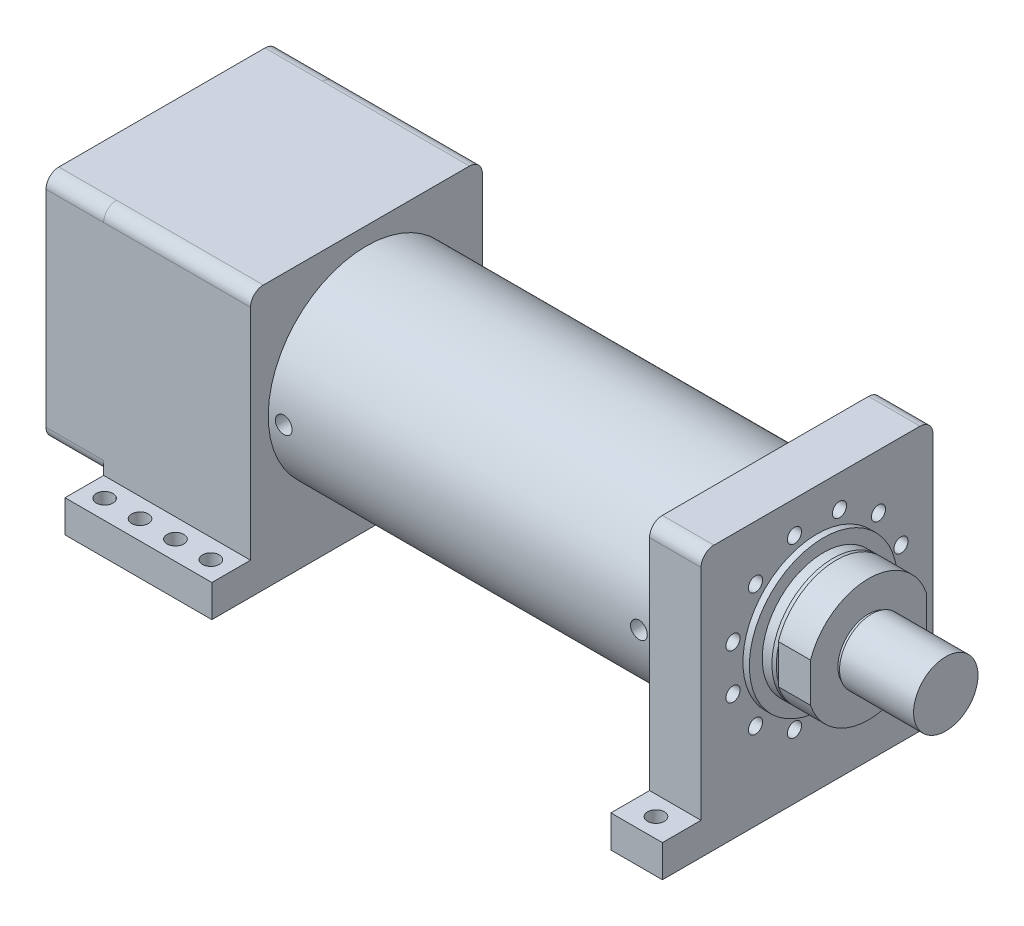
ISO-10303-21;
HEADER;
FILE_DESCRIPTION(('STEP AP214'),'2;1');
FILE_NAME('part.step','',(''),(''),'','','');
FILE_SCHEMA(('AUTOMOTIVE_DESIGN { 1 0 10303 214 1 1 1 1 }'));
ENDSEC;
DATA;
#1=APPLICATION_CONTEXT('core data for automotive mechanical design processes');
#2=APPLICATION_PROTOCOL_DEFINITION('international standard','automotive_design',2000,#1);
#3=PRODUCT_CONTEXT('',#1,'mechanical');
#4=PRODUCT('Part','Part','',(#3));
#5=PRODUCT_RELATED_PRODUCT_CATEGORY('part','',(#4));
#6=PRODUCT_DEFINITION_FORMATION('','',#4);
#7=PRODUCT_DEFINITION_CONTEXT('part definition',#1,'design');
#8=PRODUCT_DEFINITION('design','',#6,#7);
#9=PRODUCT_DEFINITION_SHAPE('','',#8);
#10=(LENGTH_UNIT() NAMED_UNIT(*) SI_UNIT(.MILLI.,.METRE.));
#11=(NAMED_UNIT(*) PLANE_ANGLE_UNIT() SI_UNIT($,.RADIAN.));
#12=(NAMED_UNIT(*) SI_UNIT($,.STERADIAN.) SOLID_ANGLE_UNIT());
#13=UNCERTAINTY_MEASURE_WITH_UNIT(LENGTH_MEASURE(1.E-05),#10,'distance_accuracy_value','');
#14=(GEOMETRIC_REPRESENTATION_CONTEXT(3) GLOBAL_UNCERTAINTY_ASSIGNED_CONTEXT((#13)) GLOBAL_UNIT_ASSIGNED_CONTEXT((#10,
#11,#12)) REPRESENTATION_CONTEXT('',''));
#15=CARTESIAN_POINT('',(0.,0.,0.));
#16=DIRECTION('',(0.,0.,1.));
#17=DIRECTION('',(1.,0.,0.));
#18=AXIS2_PLACEMENT_3D('',#15,#16,#17);
#19=CARTESIAN_POINT('',(779.5,0.,0.));
#20=DIRECTION('',(-1.,0.,0.));
#21=DIRECTION('',(0.,0.,1.));
#22=AXIS2_PLACEMENT_3D('',#19,#20,#21);
#23=CYLINDRICAL_SURFACE('',#22,95.);
#24=CARTESIAN_POINT('',(729.5,0.,0.));
#25=DIRECTION('',(1.,0.,0.));
#26=DIRECTION('',(0.,0.,-1.));
#27=AXIS2_PLACEMENT_3D('',#24,#25,#26);
#28=CIRCLE('',#27,95.);
#29=CARTESIAN_POINT('',(729.5,30.4138126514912,-90.));
#30=VERTEX_POINT('',#29);
#31=CARTESIAN_POINT('',(729.5,30.4138126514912,90.));
#32=VERTEX_POINT('',#31);
#33=EDGE_CURVE('E116',#30,#32,#28,.T.);
#34=ORIENTED_EDGE('',*,*,#33,.T.);
#35=DIRECTION('',(-1.,0.,0.));
#36=VECTOR('',#35,1.);
#37=CARTESIAN_POINT('',(779.5,30.4138126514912,90.));
#38=LINE('',#37,#36);
#39=CARTESIAN_POINT('',(779.5,30.4138126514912,90.));
#40=VERTEX_POINT('',#39);
#41=EDGE_CURVE('E53',#40,#32,#38,.T.);
#42=ORIENTED_EDGE('',*,*,#41,.F.);
#43=CARTESIAN_POINT('',(779.5,0.,0.));
#44=DIRECTION('',(1.,0.,0.));
#45=DIRECTION('',(0.,0.,-1.));
#46=AXIS2_PLACEMENT_3D('',#43,#44,#45);
#47=CIRCLE('',#46,95.);
#48=CARTESIAN_POINT('',(779.5,30.4138126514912,-90.));
#49=VERTEX_POINT('',#48);
#50=EDGE_CURVE('E103',#49,#40,#47,.T.);
#51=ORIENTED_EDGE('',*,*,#50,.F.);
#52=DIRECTION('',(-1.,0.,0.));
#53=VECTOR('',#52,1.);
#54=CARTESIAN_POINT('',(779.5,30.4138126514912,-90.));
#55=LINE('',#54,#53);
#56=EDGE_CURVE('E112',#49,#30,#55,.T.);
#57=ORIENTED_EDGE('',*,*,#56,.T.);
#58=EDGE_LOOP('',(#34,#42,#51,#57));
#59=FACE_BOUND('',#58,.T.);
#60=ADVANCED_FACE('F50',(#59),#23,.T.);
#61=CARTESIAN_POINT('',(779.5,30.4138126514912,90.));
#62=DIRECTION('',(0.,0.,-1.));
#63=DIRECTION('',(-1.,0.,0.));
#64=AXIS2_PLACEMENT_3D('',#61,#62,#63);
#65=PLANE('',#64);
#66=DIRECTION('',(0.,-1.,0.));
#67=VECTOR('',#66,1.);
#68=CARTESIAN_POINT('',(729.5,30.4138126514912,90.));
#69=LINE('',#68,#67);
#70=CARTESIAN_POINT('',(729.5,-30.4138126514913,89.9999999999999));
#71=VERTEX_POINT('',#70);
#72=EDGE_CURVE('E108',#32,#71,#69,.T.);
#73=ORIENTED_EDGE('',*,*,#72,.T.);
#74=DIRECTION('',(-1.,0.,0.));
#75=VECTOR('',#74,1.);
#76=CARTESIAN_POINT('',(779.5,-30.4138126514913,89.9999999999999));
#77=LINE('',#76,#75);
#78=CARTESIAN_POINT('',(779.5,-30.4138126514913,89.9999999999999));
#79=VERTEX_POINT('',#78);
#80=EDGE_CURVE('E106',#79,#71,#77,.T.);
#81=ORIENTED_EDGE('',*,*,#80,.F.);
#82=DIRECTION('',(0.,-1.,0.));
#83=VECTOR('',#82,1.);
#84=CARTESIAN_POINT('',(779.5,30.4138126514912,90.));
#85=LINE('',#84,#83);
#86=EDGE_CURVE('E98',#40,#79,#85,.T.);
#87=ORIENTED_EDGE('',*,*,#86,.F.);
#88=ORIENTED_EDGE('',*,*,#41,.T.);
#89=EDGE_LOOP('',(#73,#81,#87,#88));
#90=FACE_BOUND('',#89,.T.);
#91=ADVANCED_FACE('F107',(#90),#65,.F.);
#92=CARTESIAN_POINT('',(779.5,0.,0.));
#93=DIRECTION('',(-1.,0.,0.));
#94=DIRECTION('',(0.,0.,1.));
#95=AXIS2_PLACEMENT_3D('',#92,#93,#94);
#96=CYLINDRICAL_SURFACE('',#95,95.);
#97=CARTESIAN_POINT('',(729.5,0.,0.));
#98=DIRECTION('',(1.,0.,0.));
#99=DIRECTION('',(0.,0.,-1.));
#100=AXIS2_PLACEMENT_3D('',#97,#98,#99);
#101=CIRCLE('',#100,95.);
#102=CARTESIAN_POINT('',(729.5,-30.4138126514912,-90.));
#103=VERTEX_POINT('',#102);
#104=EDGE_CURVE('E84',#71,#103,#101,.T.);
#105=ORIENTED_EDGE('',*,*,#104,.T.);
#106=DIRECTION('',(-1.,0.,0.));
#107=VECTOR('',#106,1.);
#108=CARTESIAN_POINT('',(779.5,-30.4138126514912,-90.));
#109=LINE('',#108,#107);
#110=CARTESIAN_POINT('',(779.5,-30.4138126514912,-90.));
#111=VERTEX_POINT('',#110);
#112=EDGE_CURVE('E109',#111,#103,#109,.T.);
#113=ORIENTED_EDGE('',*,*,#112,.F.);
#114=CARTESIAN_POINT('',(779.5,0.,0.));
#115=DIRECTION('',(1.,0.,0.));
#116=DIRECTION('',(0.,0.,-1.));
#117=AXIS2_PLACEMENT_3D('',#114,#115,#116);
#118=CIRCLE('',#117,95.);
#119=EDGE_CURVE('E101',#79,#111,#118,.T.);
#120=ORIENTED_EDGE('',*,*,#119,.F.);
#121=ORIENTED_EDGE('',*,*,#80,.T.);
#122=EDGE_LOOP('',(#105,#113,#120,#121));
#123=FACE_BOUND('',#122,.T.);
#124=ADVANCED_FACE('F110',(#123),#96,.T.);
#125=CARTESIAN_POINT('',(779.5,30.4138126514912,-90.));
#126=DIRECTION('',(0.,0.,1.));
#127=DIRECTION('',(1.,0.,0.));
#128=AXIS2_PLACEMENT_3D('',#125,#126,#127);
#129=PLANE('',#128);
#130=DIRECTION('',(0.,1.,0.));
#131=VECTOR('',#130,1.);
#132=CARTESIAN_POINT('',(729.5,30.4138126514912,-90.));
#133=LINE('',#132,#131);
#134=EDGE_CURVE('E90',#103,#30,#133,.T.);
#135=ORIENTED_EDGE('',*,*,#134,.T.);
#136=ORIENTED_EDGE('',*,*,#56,.F.);
#137=DIRECTION('',(0.,1.,0.));
#138=VECTOR('',#137,1.);
#139=CARTESIAN_POINT('',(779.5,30.4138126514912,-90.));
#140=LINE('',#139,#138);
#141=EDGE_CURVE('E67',#111,#49,#140,.T.);
#142=ORIENTED_EDGE('',*,*,#141,.F.);
#143=ORIENTED_EDGE('',*,*,#112,.T.);
#144=EDGE_LOOP('',(#135,#136,#142,#143));
#145=FACE_BOUND('',#144,.T.);
#146=ADVANCED_FACE('F124',(#145),#129,.F.);
#147=CARTESIAN_POINT('',(779.5,0.,0.));
#148=DIRECTION('',(1.,0.,0.));
#149=DIRECTION('',(0.,0.,-1.));
#150=AXIS2_PLACEMENT_3D('',#147,#148,#149);
#151=PLANE('',#150);
#152=CARTESIAN_POINT('',(779.5,0.,0.));
#153=DIRECTION('',(1.,0.,0.));
#154=DIRECTION('',(0.,0.,-1.));
#155=AXIS2_PLACEMENT_3D('',#152,#153,#154);
#156=CIRCLE('',#155,47.5);
#157=CARTESIAN_POINT('',(779.5,0.,-47.5));
#158=VERTEX_POINT('',#157);
#159=EDGE_CURVE('E12',#158,#158,#156,.T.);
#160=ORIENTED_EDGE('',*,*,#159,.F.);
#161=EDGE_LOOP('',(#160));
#162=FACE_BOUND('',#161,.T.);
#163=ORIENTED_EDGE('',*,*,#50,.T.);
#164=ORIENTED_EDGE('',*,*,#86,.T.);
#165=ORIENTED_EDGE('',*,*,#119,.T.);
#166=ORIENTED_EDGE('',*,*,#141,.T.);
#167=EDGE_LOOP('',(#163,#164,#165,#166));
#168=FACE_BOUND('',#167,.T.);
#169=ADVANCED_FACE('F99',(#162,#168),#151,.T.);
#170=CARTESIAN_POINT('',(729.5,0.,0.));
#171=DIRECTION('',(1.,0.,0.));
#172=DIRECTION('',(0.,0.,-1.));
#173=AXIS2_PLACEMENT_3D('',#170,#171,#172);
#174=PLANE('',#173);
#175=ORIENTED_EDGE('',*,*,#33,.F.);
#176=ORIENTED_EDGE('',*,*,#134,.F.);
#177=ORIENTED_EDGE('',*,*,#104,.F.);
#178=ORIENTED_EDGE('',*,*,#72,.F.);
#179=EDGE_LOOP('',(#175,#176,#177,#178));
#180=FACE_BOUND('',#179,.T.);
#181=ADVANCED_FACE('F127',(#180),#174,.F.);
#182=CARTESIAN_POINT('',(784.5,0.,0.));
#183=DIRECTION('',(-1.,0.,0.));
#184=DIRECTION('',(0.,0.,1.));
#185=AXIS2_PLACEMENT_3D('',#182,#183,#184);
#186=CYLINDRICAL_SURFACE('',#185,47.5);
#187=CARTESIAN_POINT('',(784.5,0.,0.));
#188=DIRECTION('',(1.,0.,0.));
#189=DIRECTION('',(0.,0.,-1.));
#190=AXIS2_PLACEMENT_3D('',#187,#188,#189);
#191=CIRCLE('',#190,47.5);
#192=CARTESIAN_POINT('',(784.5,0.,-47.5));
#193=VERTEX_POINT('',#192);
#194=EDGE_CURVE('E119',#193,#193,#191,.T.);
#195=ORIENTED_EDGE('',*,*,#194,.F.);
#196=EDGE_LOOP('',(#195));
#197=FACE_BOUND('',#196,.T.);
#198=ORIENTED_EDGE('',*,*,#159,.T.);
#199=EDGE_LOOP('',(#198));
#200=FACE_BOUND('',#199,.T.);
#201=ADVANCED_FACE('F144',(#197,#200),#186,.T.);
#202=CARTESIAN_POINT('',(899.5,0.,0.));
#203=DIRECTION('',(-1.,0.,0.));
#204=DIRECTION('',(0.,0.,1.));
#205=AXIS2_PLACEMENT_3D('',#202,#203,#204);
#206=CYLINDRICAL_SURFACE('',#205,50.);
#207=CARTESIAN_POINT('',(899.5,0.,0.));
#208=DIRECTION('',(1.,0.,0.));
#209=DIRECTION('',(0.,0.,-1.));
#210=AXIS2_PLACEMENT_3D('',#207,#208,#209);
#211=CIRCLE('',#210,50.);
#212=CARTESIAN_POINT('',(899.5,0.,-50.));
#213=VERTEX_POINT('',#212);
#214=EDGE_CURVE('E132',#213,#213,#211,.T.);
#215=ORIENTED_EDGE('',*,*,#214,.F.);
#216=EDGE_LOOP('',(#215));
#217=FACE_BOUND('',#216,.T.);
#218=CARTESIAN_POINT('',(784.5,0.,0.));
#219=DIRECTION('',(1.,0.,0.));
#220=DIRECTION('',(0.,0.,-1.));
#221=AXIS2_PLACEMENT_3D('',#218,#219,#220);
#222=CIRCLE('',#221,50.);
#223=CARTESIAN_POINT('',(784.5,0.,-50.));
#224=VERTEX_POINT('',#223);
#225=EDGE_CURVE('E133',#224,#224,#222,.T.);
#226=ORIENTED_EDGE('',*,*,#225,.T.);
#227=EDGE_LOOP('',(#226));
#228=FACE_BOUND('',#227,.T.);
#229=ADVANCED_FACE('F141',(#217,#228),#206,.T.);
#230=CARTESIAN_POINT('',(899.5,0.,0.));
#231=DIRECTION('',(1.,0.,0.));
#232=DIRECTION('',(0.,0.,-1.));
#233=AXIS2_PLACEMENT_3D('',#230,#231,#232);
#234=PLANE('',#233);
#235=ORIENTED_EDGE('',*,*,#214,.T.);
#236=EDGE_LOOP('',(#235));
#237=FACE_BOUND('',#236,.T.);
#238=ADVANCED_FACE('F139',(#237),#234,.T.);
#239=CARTESIAN_POINT('',(784.5,0.,0.));
#240=DIRECTION('',(1.,0.,0.));
#241=DIRECTION('',(0.,0.,-1.));
#242=AXIS2_PLACEMENT_3D('',#239,#240,#241);
#243=PLANE('',#242);
#244=ORIENTED_EDGE('',*,*,#194,.T.);
#245=EDGE_LOOP('',(#244));
#246=FACE_BOUND('',#245,.T.);
#247=ORIENTED_EDGE('',*,*,#225,.F.);
#248=EDGE_LOOP('',(#247));
#249=FACE_BOUND('',#248,.T.);
#250=ADVANCED_FACE('F148',(#246,#249),#243,.F.);
#251=CLOSED_SHELL('',(#60,#91,#124,#146,#169,#181,#201,#229,#238,#250));
#252=MANIFOLD_SOLID_BREP('B2',#251);
#253=CARTESIAN_POINT('',(729.5,0.,0.));
#254=DIRECTION('',(-1.,0.,0.));
#255=DIRECTION('',(0.,0.,1.));
#256=AXIS2_PLACEMENT_3D('',#253,#254,#255);
#257=CYLINDRICAL_SURFACE('',#256,95.);
#258=CARTESIAN_POINT('',(724.5,0.,0.));
#259=DIRECTION('',(1.,0.,0.));
#260=DIRECTION('',(0.,0.,-1.));
#261=AXIS2_PLACEMENT_3D('',#258,#259,#260);
#262=CIRCLE('',#261,95.);
#263=CARTESIAN_POINT('',(724.5,0.,-95.));
#264=VERTEX_POINT('',#263);
#265=EDGE_CURVE('E49',#264,#264,#262,.F.);
#266=ORIENTED_EDGE('',*,*,#265,.T.);
#267=EDGE_LOOP('',(#266));
#268=FACE_BOUND('',#267,.T.);
#269=CARTESIAN_POINT('',(709.5,0.,0.));
#270=DIRECTION('',(1.,0.,0.));
#271=DIRECTION('',(0.,0.,-1.));
#272=AXIS2_PLACEMENT_3D('',#269,#270,#271);
#273=CIRCLE('',#272,95.);
#274=CARTESIAN_POINT('',(709.5,0.,-95.));
#275=VERTEX_POINT('',#274);
#276=EDGE_CURVE('E253',#275,#275,#273,.T.);
#277=ORIENTED_EDGE('',*,*,#276,.T.);
#278=EDGE_LOOP('',(#277));
#279=FACE_BOUND('',#278,.T.);
#280=ADVANCED_FACE('F242',(#268,#279),#257,.T.);
#281=CARTESIAN_POINT('',(729.5,0.,0.));
#282=DIRECTION('',(1.,0.,0.));
#283=DIRECTION('',(0.,0.,-1.));
#284=AXIS2_PLACEMENT_3D('',#281,#282,#283);
#285=PLANE('',#284);
#286=CARTESIAN_POINT('',(729.5,0.,0.));
#287=DIRECTION('',(1.,0.,0.));
#288=DIRECTION('',(0.,0.,-1.));
#289=AXIS2_PLACEMENT_3D('',#286,#287,#288);
#290=CIRCLE('',#289,93.180148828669);
#291=CARTESIAN_POINT('',(729.5,0.,-93.180148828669));
#292=VERTEX_POINT('',#291);
#293=EDGE_CURVE('E249',#292,#292,#290,.T.);
#294=ORIENTED_EDGE('',*,*,#293,.T.);
#295=EDGE_LOOP('',(#294));
#296=FACE_BOUND('',#295,.T.);
#297=ADVANCED_FACE('F263',(#296),#285,.T.);
#298=CARTESIAN_POINT('',(709.5,0.,0.));
#299=DIRECTION('',(1.,0.,0.));
#300=DIRECTION('',(0.,0.,-1.));
#301=AXIS2_PLACEMENT_3D('',#298,#299,#300);
#302=PLANE('',#301);
#303=ORIENTED_EDGE('',*,*,#276,.F.);
#304=EDGE_LOOP('',(#303));
#305=FACE_BOUND('',#304,.T.);
#306=ADVANCED_FACE('F261',(#305),#302,.F.);
#307=CARTESIAN_POINT('',(729.5,0.,0.));
#308=DIRECTION('',(-1.,0.,0.));
#309=DIRECTION('',(0.,0.,1.));
#310=AXIS2_PLACEMENT_3D('',#307,#308,#309);
#311=CONICAL_SURFACE('',#310,93.180148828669,0.349065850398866);
#312=ORIENTED_EDGE('',*,*,#265,.F.);
#313=EDGE_LOOP('',(#312));
#314=FACE_BOUND('',#313,.T.);
#315=ORIENTED_EDGE('',*,*,#293,.F.);
#316=EDGE_LOOP('',(#315));
#317=FACE_BOUND('',#316,.T.);
#318=ADVANCED_FACE('F244',(#314,#317),#311,.T.);
#319=CLOSED_SHELL('',(#280,#297,#306,#318));
#320=MANIFOLD_SOLID_BREP('B6',#319);
#321=CARTESIAN_POINT('',(709.5,0.,0.));
#322=DIRECTION('',(-1.,0.,0.));
#323=DIRECTION('',(0.,0.,1.));
#324=AXIS2_PLACEMENT_3D('',#321,#322,#323);
#325=CYLINDRICAL_SURFACE('',#324,115.);
#326=CARTESIAN_POINT('',(709.5,0.,0.));
#327=DIRECTION('',(1.,0.,0.));
#328=DIRECTION('',(0.,0.,-1.));
#329=AXIS2_PLACEMENT_3D('',#326,#327,#328);
#330=CIRCLE('',#329,115.);
#331=CARTESIAN_POINT('',(709.5,0.,-115.));
#332=VERTEX_POINT('',#331);
#333=EDGE_CURVE('E241',#332,#332,#330,.T.);
#334=ORIENTED_EDGE('',*,*,#333,.F.);
#335=EDGE_LOOP('',(#334));
#336=FACE_BOUND('',#335,.T.);
#337=CARTESIAN_POINT('',(699.5,0.,0.));
#338=DIRECTION('',(1.,0.,0.));
#339=DIRECTION('',(0.,0.,-1.));
#340=AXIS2_PLACEMENT_3D('',#337,#338,#339);
#341=CIRCLE('',#340,115.);
#342=CARTESIAN_POINT('',(699.5,0.,-115.));
#343=VERTEX_POINT('',#342);
#344=EDGE_CURVE('E310',#343,#343,#341,.T.);
#345=ORIENTED_EDGE('',*,*,#344,.T.);
#346=EDGE_LOOP('',(#345));
#347=FACE_BOUND('',#346,.T.);
#348=ADVANCED_FACE('F307',(#336,#347),#325,.T.);
#349=CARTESIAN_POINT('',(709.5,0.,0.));
#350=DIRECTION('',(1.,0.,0.));
#351=DIRECTION('',(0.,0.,-1.));
#352=AXIS2_PLACEMENT_3D('',#349,#350,#351);
#353=PLANE('',#352);
#354=ORIENTED_EDGE('',*,*,#333,.T.);
#355=EDGE_LOOP('',(#354));
#356=FACE_BOUND('',#355,.T.);
#357=ADVANCED_FACE('F322',(#356),#353,.T.);
#358=CARTESIAN_POINT('',(699.5,0.,0.));
#359=DIRECTION('',(1.,0.,0.));
#360=DIRECTION('',(0.,0.,-1.));
#361=AXIS2_PLACEMENT_3D('',#358,#359,#360);
#362=PLANE('',#361);
#363=ORIENTED_EDGE('',*,*,#344,.F.);
#364=EDGE_LOOP('',(#363));
#365=FACE_BOUND('',#364,.T.);
#366=ADVANCED_FACE('F320',(#365),#362,.F.);
#367=CLOSED_SHELL('',(#348,#357,#366));
#368=MANIFOLD_SOLID_BREP('B44',#367);
#369=CARTESIAN_POINT('',(0.,-180.,0.));
#370=DIRECTION('',(0.,-1.,0.));
#371=DIRECTION('',(1.,0.,0.));
#372=AXIS2_PLACEMENT_3D('',#369,#370,#371);
#373=PLANE('',#372);
#374=CARTESIAN_POINT('',(-31.5000000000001,-180.,210.));
#375=DIRECTION('',(0.,-1.,0.));
#376=DIRECTION('',(1.,0.,0.));
#377=AXIS2_PLACEMENT_3D('',#374,#375,#376);
#378=CIRCLE('',#377,13.);
#379=CARTESIAN_POINT('',(-18.5000000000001,-180.,210.));
#380=VERTEX_POINT('',#379);
#381=EDGE_CURVE('E967',#380,#380,#378,.T.);
#382=ORIENTED_EDGE('',*,*,#381,.T.);
#383=EDGE_LOOP('',(#382));
#384=FACE_BOUND('',#383,.T.);
#385=CARTESIAN_POINT('',(-86.5000000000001,-180.,210.));
#386=DIRECTION('',(0.,-1.,0.));
#387=DIRECTION('',(1.,0.,0.));
#388=AXIS2_PLACEMENT_3D('',#385,#386,#387);
#389=CIRCLE('',#388,13.);
#390=CARTESIAN_POINT('',(-73.5000000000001,-180.,210.));
#391=VERTEX_POINT('',#390);
#392=EDGE_CURVE('E975',#391,#391,#389,.T.);
#393=ORIENTED_EDGE('',*,*,#392,.T.);
#394=EDGE_LOOP('',(#393));
#395=FACE_BOUND('',#394,.T.);
#396=CARTESIAN_POINT('',(-141.5,-180.,210.));
#397=DIRECTION('',(0.,-1.,0.));
#398=DIRECTION('',(1.,0.,0.));
#399=AXIS2_PLACEMENT_3D('',#396,#397,#398);
#400=CIRCLE('',#399,13.);
#401=CARTESIAN_POINT('',(-128.5,-180.,210.));
#402=VERTEX_POINT('',#401);
#403=EDGE_CURVE('E982',#402,#402,#400,.T.);
#404=ORIENTED_EDGE('',*,*,#403,.T.);
#405=EDGE_LOOP('',(#404));
#406=FACE_BOUND('',#405,.T.);
#407=CARTESIAN_POINT('',(-196.5,-180.,210.));
#408=DIRECTION('',(0.,-1.,0.));
#409=DIRECTION('',(1.,0.,0.));
#410=AXIS2_PLACEMENT_3D('',#407,#408,#409);
#411=CIRCLE('',#410,13.);
#412=CARTESIAN_POINT('',(-183.5,-180.,210.));
#413=VERTEX_POINT('',#412);
#414=EDGE_CURVE('E990',#413,#413,#411,.T.);
#415=ORIENTED_EDGE('',*,*,#414,.T.);
#416=EDGE_LOOP('',(#415));
#417=FACE_BOUND('',#416,.T.);
#418=DIRECTION('',(0.,0.,1.));
#419=VECTOR('',#418,1.);
#420=CARTESIAN_POINT('',(0.,-180.,240.));
#421=LINE('',#420,#419);
#422=CARTESIAN_POINT('',(0.,-180.,180.));
#423=VERTEX_POINT('',#422);
#424=CARTESIAN_POINT('',(0.,-180.,240.));
#425=VERTEX_POINT('',#424);
#426=EDGE_CURVE('E1024',#423,#425,#421,.T.);
#427=ORIENTED_EDGE('',*,*,#426,.F.);
#428=DIRECTION('',(1.,0.,0.));
#429=VECTOR('',#428,1.);
#430=CARTESIAN_POINT('',(-228.,-180.,180.));
#431=LINE('',#430,#429);
#432=CARTESIAN_POINT('',(-228.,-180.,180.));
#433=VERTEX_POINT('',#432);
#434=EDGE_CURVE('E1053',#433,#423,#431,.T.);
#435=ORIENTED_EDGE('',*,*,#434,.F.);
#436=DIRECTION('',(0.,0.,-1.));
#437=VECTOR('',#436,1.);
#438=CARTESIAN_POINT('',(-228.,-180.,240.));
#439=LINE('',#438,#437);
#440=CARTESIAN_POINT('',(-228.,-180.,240.));
#441=VERTEX_POINT('',#440);
#442=EDGE_CURVE('E1017',#441,#433,#439,.T.);
#443=ORIENTED_EDGE('',*,*,#442,.F.);
#444=DIRECTION('',(-1.,0.,0.));
#445=VECTOR('',#444,1.);
#446=CARTESIAN_POINT('',(-228.,-180.,240.));
#447=LINE('',#446,#445);
#448=EDGE_CURVE('E1007',#425,#441,#447,.T.);
#449=ORIENTED_EDGE('',*,*,#448,.F.);
#450=EDGE_LOOP('',(#427,#435,#443,#449));
#451=FACE_BOUND('',#450,.T.);
#452=ADVANCED_FACE('F348',(#384,#395,#406,#417,#451),#373,.F.);
#453=CARTESIAN_POINT('',(-196.5,-180.,-210.));
#454=DIRECTION('',(0.,-1.,0.));
#455=DIRECTION('',(-1.,0.,0.));
#456=AXIS2_PLACEMENT_3D('',#453,#454,#455);
#457=CIRCLE('',#456,13.);
#458=CARTESIAN_POINT('',(-209.5,-180.,-210.));
#459=VERTEX_POINT('',#458);
#460=EDGE_CURVE('E938',#459,#459,#457,.T.);
#461=ORIENTED_EDGE('',*,*,#460,.T.);
#462=EDGE_LOOP('',(#461));
#463=FACE_BOUND('',#462,.T.);
#464=CARTESIAN_POINT('',(-141.5,-180.,-210.));
#465=DIRECTION('',(0.,-1.,0.));
#466=DIRECTION('',(-1.,0.,0.));
#467=AXIS2_PLACEMENT_3D('',#464,#465,#466);
#468=CIRCLE('',#467,13.);
#469=CARTESIAN_POINT('',(-154.5,-180.,-210.));
#470=VERTEX_POINT('',#469);
#471=EDGE_CURVE('E943',#470,#470,#468,.T.);
#472=ORIENTED_EDGE('',*,*,#471,.T.);
#473=EDGE_LOOP('',(#472));
#474=FACE_BOUND('',#473,.T.);
#475=CARTESIAN_POINT('',(-86.5,-180.,-210.));
#476=DIRECTION('',(0.,-1.,0.));
#477=DIRECTION('',(-1.,0.,0.));
#478=AXIS2_PLACEMENT_3D('',#475,#476,#477);
#479=CIRCLE('',#478,13.);
#480=CARTESIAN_POINT('',(-99.5000000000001,-180.,-210.));
#481=VERTEX_POINT('',#480);
#482=EDGE_CURVE('E951',#481,#481,#479,.T.);
#483=ORIENTED_EDGE('',*,*,#482,.T.);
#484=EDGE_LOOP('',(#483));
#485=FACE_BOUND('',#484,.T.);
#486=CARTESIAN_POINT('',(-31.5000000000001,-180.,-210.));
#487=DIRECTION('',(0.,-1.,0.));
#488=DIRECTION('',(-1.,0.,0.));
#489=AXIS2_PLACEMENT_3D('',#486,#487,#488);
#490=CIRCLE('',#489,13.);
#491=CARTESIAN_POINT('',(-44.5000000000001,-180.,-210.));
#492=VERTEX_POINT('',#491);
#493=EDGE_CURVE('E959',#492,#492,#490,.T.);
#494=ORIENTED_EDGE('',*,*,#493,.T.);
#495=EDGE_LOOP('',(#494));
#496=FACE_BOUND('',#495,.T.);
#497=DIRECTION('',(1.,0.,0.));
#498=VECTOR('',#497,1.);
#499=CARTESIAN_POINT('',(-228.,-180.,-180.));
#500=LINE('',#499,#498);
#501=CARTESIAN_POINT('',(-228.,-180.,-180.));
#502=VERTEX_POINT('',#501);
#503=CARTESIAN_POINT('',(0.,-180.,-180.));
#504=VERTEX_POINT('',#503);
#505=EDGE_CURVE('E1056',#502,#504,#500,.T.);
#506=ORIENTED_EDGE('',*,*,#505,.T.);
#507=CARTESIAN_POINT('',(0.,-180.,-240.));
#508=VERTEX_POINT('',#507);
#509=EDGE_CURVE('E1025',#508,#504,#421,.T.);
#510=ORIENTED_EDGE('',*,*,#509,.F.);
#511=DIRECTION('',(1.,0.,0.));
#512=VECTOR('',#511,1.);
#513=CARTESIAN_POINT('',(-228.,-180.,-240.));
#514=LINE('',#513,#512);
#515=CARTESIAN_POINT('',(-228.,-180.,-240.));
#516=VERTEX_POINT('',#515);
#517=EDGE_CURVE('E1021',#516,#508,#514,.T.);
#518=ORIENTED_EDGE('',*,*,#517,.F.);
#519=EDGE_CURVE('E998',#502,#516,#439,.T.);
#520=ORIENTED_EDGE('',*,*,#519,.F.);
#521=EDGE_LOOP('',(#506,#510,#518,#520));
#522=FACE_BOUND('',#521,.T.);
#523=ADVANCED_FACE('F819',(#463,#474,#485,#496,#522),#373,.F.);
#524=CARTESIAN_POINT('',(-228.,0.,0.));
#525=DIRECTION('',(-1.,0.,0.));
#526=DIRECTION('',(0.,-1.,0.));
#527=AXIS2_PLACEMENT_3D('',#524,#525,#526);
#528=PLANE('',#527);
#529=DIRECTION('',(0.,1.,0.));
#530=VECTOR('',#529,1.);
#531=CARTESIAN_POINT('',(-228.,180.,180.));
#532=LINE('',#531,#530);
#533=CARTESIAN_POINT('',(-228.,-160.,180.));
#534=VERTEX_POINT('',#533);
#535=EDGE_CURVE('E1046',#433,#534,#532,.T.);
#536=ORIENTED_EDGE('',*,*,#535,.T.);
#537=CARTESIAN_POINT('',(-228.,-160.,160.));
#538=DIRECTION('',(-1.,0.,0.));
#539=DIRECTION('',(0.,-1.,0.));
#540=AXIS2_PLACEMENT_3D('',#537,#538,#539);
#541=CIRCLE('',#540,20.);
#542=CARTESIAN_POINT('',(-228.,-180.,160.));
#543=VERTEX_POINT('',#542);
#544=EDGE_CURVE('E902',#534,#543,#541,.F.);
#545=ORIENTED_EDGE('',*,*,#544,.T.);
#546=DIRECTION('',(0.,0.,1.));
#547=VECTOR('',#546,1.);
#548=CARTESIAN_POINT('',(-228.,-180.,-180.));
#549=LINE('',#548,#547);
#550=CARTESIAN_POINT('',(-228.,-180.,-160.));
#551=VERTEX_POINT('',#550);
#552=EDGE_CURVE('E1119',#551,#543,#549,.T.);
#553=ORIENTED_EDGE('',*,*,#552,.F.);
#554=CARTESIAN_POINT('',(-228.,-160.,-160.));
#555=DIRECTION('',(-1.,0.,0.));
#556=DIRECTION('',(0.,-1.,0.));
#557=AXIS2_PLACEMENT_3D('',#554,#555,#556);
#558=CIRCLE('',#557,20.);
#559=CARTESIAN_POINT('',(-228.,-160.,-180.));
#560=VERTEX_POINT('',#559);
#561=EDGE_CURVE('E886',#551,#560,#558,.F.);
#562=ORIENTED_EDGE('',*,*,#561,.T.);
#563=DIRECTION('',(0.,-1.,0.));
#564=VECTOR('',#563,1.);
#565=CARTESIAN_POINT('',(-228.,180.,-180.));
#566=LINE('',#565,#564);
#567=EDGE_CURVE('E1050',#560,#502,#566,.T.);
#568=ORIENTED_EDGE('',*,*,#567,.T.);
#569=ORIENTED_EDGE('',*,*,#519,.T.);
#570=DIRECTION('',(0.,1.,0.));
#571=VECTOR('',#570,1.);
#572=CARTESIAN_POINT('',(-228.,-230.,-240.));
#573=LINE('',#572,#571);
#574=CARTESIAN_POINT('',(-228.,-230.,-240.));
#575=VERTEX_POINT('',#574);
#576=EDGE_CURVE('E1042',#575,#516,#573,.T.);
#577=ORIENTED_EDGE('',*,*,#576,.F.);
#578=DIRECTION('',(0.,0.,-1.));
#579=VECTOR('',#578,1.);
#580=CARTESIAN_POINT('',(-228.,-230.,240.));
#581=LINE('',#580,#579);
#582=CARTESIAN_POINT('',(-228.,-230.,240.));
#583=VERTEX_POINT('',#582);
#584=EDGE_CURVE('E1002',#583,#575,#581,.T.);
#585=ORIENTED_EDGE('',*,*,#584,.F.);
#586=DIRECTION('',(0.,1.,0.));
#587=VECTOR('',#586,1.);
#588=CARTESIAN_POINT('',(-228.,-230.,240.));
#589=LINE('',#588,#587);
#590=EDGE_CURVE('E1016',#583,#441,#589,.T.);
#591=ORIENTED_EDGE('',*,*,#590,.T.);
#592=ORIENTED_EDGE('',*,*,#442,.T.);
#593=EDGE_LOOP('',(#536,#545,#553,#562,#568,#569,#577,#585,#591,#592));
#594=FACE_BOUND('',#593,.T.);
#595=ADVANCED_FACE('F825',(#594),#528,.T.);
#596=CARTESIAN_POINT('',(-228.,180.,180.));
#597=DIRECTION('',(0.,0.,-1.));
#598=DIRECTION('',(-1.,0.,0.));
#599=AXIS2_PLACEMENT_3D('',#596,#597,#598);
#600=PLANE('',#599);
#601=DIRECTION('',(0.,1.,0.));
#602=VECTOR('',#601,1.);
#603=CARTESIAN_POINT('',(0.,180.,180.));
#604=LINE('',#603,#602);
#605=CARTESIAN_POINT('',(0.,160.,180.));
#606=VERTEX_POINT('',#605);
#607=EDGE_CURVE('E566',#423,#606,#604,.T.);
#608=ORIENTED_EDGE('',*,*,#607,.T.);
#609=DIRECTION('',(1.,0.,0.));
#610=VECTOR('',#609,1.);
#611=CARTESIAN_POINT('',(-228.,160.,180.));
#612=LINE('',#611,#610);
#613=CARTESIAN_POINT('',(-228.,160.,180.));
#614=VERTEX_POINT('',#613);
#615=EDGE_CURVE('E305',#606,#614,#612,.F.);
#616=ORIENTED_EDGE('',*,*,#615,.T.);
#617=DIRECTION('',(1.,0.,0.));
#618=VECTOR('',#617,1.);
#619=CARTESIAN_POINT('',(-317.5,160.,180.));
#620=LINE('',#619,#618);
#621=CARTESIAN_POINT('',(-317.5,160.,180.));
#622=VERTEX_POINT('',#621);
#623=EDGE_CURVE('E895',#614,#622,#620,.F.);
#624=ORIENTED_EDGE('',*,*,#623,.T.);
#625=DIRECTION('',(0.,1.,0.));
#626=VECTOR('',#625,1.);
#627=CARTESIAN_POINT('',(-317.5,180.,180.));
#628=LINE('',#627,#626);
#629=CARTESIAN_POINT('',(-317.5,-160.,180.));
#630=VERTEX_POINT('',#629);
#631=EDGE_CURVE('E1115',#630,#622,#628,.T.);
#632=ORIENTED_EDGE('',*,*,#631,.F.);
#633=DIRECTION('',(1.,0.,0.));
#634=VECTOR('',#633,1.);
#635=CARTESIAN_POINT('',(-317.5,-160.,180.));
#636=LINE('',#635,#634);
#637=EDGE_CURVE('E887',#630,#534,#636,.T.);
#638=ORIENTED_EDGE('',*,*,#637,.T.);
#639=ORIENTED_EDGE('',*,*,#535,.F.);
#640=ORIENTED_EDGE('',*,*,#434,.T.);
#641=EDGE_LOOP('',(#608,#616,#624,#632,#638,#639,#640));
#642=FACE_BOUND('',#641,.T.);
#643=ADVANCED_FACE('F847',(#642),#600,.F.);
#644=CARTESIAN_POINT('',(-228.,180.,-180.));
#645=DIRECTION('',(0.,-1.,0.));
#646=DIRECTION('',(1.,0.,0.));
#647=AXIS2_PLACEMENT_3D('',#644,#645,#646);
#648=PLANE('',#647);
#649=DIRECTION('',(0.,0.,-1.));
#650=VECTOR('',#649,1.);
#651=CARTESIAN_POINT('',(0.,180.,-180.));
#652=LINE('',#651,#650);
#653=CARTESIAN_POINT('',(0.,180.,160.));
#654=VERTEX_POINT('',#653);
#655=CARTESIAN_POINT('',(0.,180.,-160.));
#656=VERTEX_POINT('',#655);
#657=EDGE_CURVE('E570',#654,#656,#652,.T.);
#658=ORIENTED_EDGE('',*,*,#657,.T.);
#659=DIRECTION('',(1.,0.,0.));
#660=VECTOR('',#659,1.);
#661=CARTESIAN_POINT('',(-228.,180.,-160.));
#662=LINE('',#661,#660);
#663=CARTESIAN_POINT('',(-228.,180.,-160.));
#664=VERTEX_POINT('',#663);
#665=EDGE_CURVE('E357',#656,#664,#662,.F.);
#666=ORIENTED_EDGE('',*,*,#665,.T.);
#667=DIRECTION('',(1.,0.,0.));
#668=VECTOR('',#667,1.);
#669=CARTESIAN_POINT('',(-317.5,180.,-160.));
#670=LINE('',#669,#668);
#671=CARTESIAN_POINT('',(-317.5,180.,-160.));
#672=VERTEX_POINT('',#671);
#673=EDGE_CURVE('E925',#664,#672,#670,.F.);
#674=ORIENTED_EDGE('',*,*,#673,.T.);
#675=DIRECTION('',(0.,0.,-1.));
#676=VECTOR('',#675,1.);
#677=CARTESIAN_POINT('',(-317.5,180.,-180.));
#678=LINE('',#677,#676);
#679=CARTESIAN_POINT('',(-317.5,180.,160.));
#680=VERTEX_POINT('',#679);
#681=EDGE_CURVE('E1107',#680,#672,#678,.T.);
#682=ORIENTED_EDGE('',*,*,#681,.F.);
#683=DIRECTION('',(1.,0.,0.));
#684=VECTOR('',#683,1.);
#685=CARTESIAN_POINT('',(-317.5,180.,160.));
#686=LINE('',#685,#684);
#687=CARTESIAN_POINT('',(-228.,180.,160.));
#688=VERTEX_POINT('',#687);
#689=EDGE_CURVE('E928',#680,#688,#686,.T.);
#690=ORIENTED_EDGE('',*,*,#689,.T.);
#691=DIRECTION('',(1.,0.,0.));
#692=VECTOR('',#691,1.);
#693=CARTESIAN_POINT('',(-228.,180.,160.));
#694=LINE('',#693,#692);
#695=EDGE_CURVE('E1092',#688,#654,#694,.T.);
#696=ORIENTED_EDGE('',*,*,#695,.T.);
#697=EDGE_LOOP('',(#658,#666,#674,#682,#690,#696));
#698=FACE_BOUND('',#697,.T.);
#699=ADVANCED_FACE('F852',(#698),#648,.F.);
#700=CARTESIAN_POINT('',(-228.,180.,-180.));
#701=DIRECTION('',(0.,0.,1.));
#702=DIRECTION('',(1.,0.,0.));
#703=AXIS2_PLACEMENT_3D('',#700,#701,#702);
#704=PLANE('',#703);
#705=DIRECTION('',(1.,0.,0.));
#706=VECTOR('',#705,1.);
#707=CARTESIAN_POINT('',(-317.5,160.,-180.));
#708=LINE('',#707,#706);
#709=CARTESIAN_POINT('',(-317.5,160.,-180.));
#710=VERTEX_POINT('',#709);
#711=CARTESIAN_POINT('',(-228.,160.,-180.));
#712=VERTEX_POINT('',#711);
#713=EDGE_CURVE('E932',#710,#712,#708,.T.);
#714=ORIENTED_EDGE('',*,*,#713,.T.);
#715=DIRECTION('',(1.,0.,0.));
#716=VECTOR('',#715,1.);
#717=CARTESIAN_POINT('',(-228.,160.,-180.));
#718=LINE('',#717,#716);
#719=CARTESIAN_POINT('',(0.,160.,-180.));
#720=VERTEX_POINT('',#719);
#721=EDGE_CURVE('E880',#712,#720,#718,.T.);
#722=ORIENTED_EDGE('',*,*,#721,.T.);
#723=DIRECTION('',(0.,-1.,0.));
#724=VECTOR('',#723,1.);
#725=CARTESIAN_POINT('',(0.,180.,-180.));
#726=LINE('',#725,#724);
#727=EDGE_CURVE('E573',#720,#504,#726,.T.);
#728=ORIENTED_EDGE('',*,*,#727,.T.);
#729=ORIENTED_EDGE('',*,*,#505,.F.);
#730=ORIENTED_EDGE('',*,*,#567,.F.);
#731=DIRECTION('',(1.,0.,0.));
#732=VECTOR('',#731,1.);
#733=CARTESIAN_POINT('',(-317.5,-160.,-180.));
#734=LINE('',#733,#732);
#735=CARTESIAN_POINT('',(-317.5,-160.,-180.));
#736=VERTEX_POINT('',#735);
#737=EDGE_CURVE('E935',#560,#736,#734,.F.);
#738=ORIENTED_EDGE('',*,*,#737,.T.);
#739=DIRECTION('',(0.,-1.,0.));
#740=VECTOR('',#739,1.);
#741=CARTESIAN_POINT('',(-317.5,180.,-180.));
#742=LINE('',#741,#740);
#743=EDGE_CURVE('E1105',#710,#736,#742,.T.);
#744=ORIENTED_EDGE('',*,*,#743,.F.);
#745=EDGE_LOOP('',(#714,#722,#728,#729,#730,#738,#744));
#746=FACE_BOUND('',#745,.T.);
#747=ADVANCED_FACE('F849',(#746),#704,.F.);
#748=CARTESIAN_POINT('',(0.,-230.,0.));
#749=DIRECTION('',(0.,-1.,0.));
#750=DIRECTION('',(1.,0.,0.));
#751=AXIS2_PLACEMENT_3D('',#748,#749,#750);
#752=PLANE('',#751);
#753=CARTESIAN_POINT('',(-141.5,-230.,-210.));
#754=DIRECTION('',(0.,-1.,0.));
#755=DIRECTION('',(-1.,0.,0.));
#756=AXIS2_PLACEMENT_3D('',#753,#754,#755);
#757=CIRCLE('',#756,13.);
#758=CARTESIAN_POINT('',(-154.5,-230.,-210.));
#759=VERTEX_POINT('',#758);
#760=EDGE_CURVE('E947',#759,#759,#757,.T.);
#761=ORIENTED_EDGE('',*,*,#760,.F.);
#762=EDGE_LOOP('',(#761));
#763=FACE_BOUND('',#762,.T.);
#764=CARTESIAN_POINT('',(-31.5000000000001,-230.,-210.));
#765=DIRECTION('',(0.,-1.,0.));
#766=DIRECTION('',(-1.,0.,0.));
#767=AXIS2_PLACEMENT_3D('',#764,#765,#766);
#768=CIRCLE('',#767,13.);
#769=CARTESIAN_POINT('',(-44.5000000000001,-230.,-210.));
#770=VERTEX_POINT('',#769);
#771=EDGE_CURVE('E963',#770,#770,#768,.T.);
#772=ORIENTED_EDGE('',*,*,#771,.F.);
#773=EDGE_LOOP('',(#772));
#774=FACE_BOUND('',#773,.T.);
#775=CARTESIAN_POINT('',(-86.5000000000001,-230.,210.));
#776=DIRECTION('',(0.,-1.,0.));
#777=DIRECTION('',(1.,0.,0.));
#778=AXIS2_PLACEMENT_3D('',#775,#776,#777);
#779=CIRCLE('',#778,13.);
#780=CARTESIAN_POINT('',(-73.5000000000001,-230.,210.));
#781=VERTEX_POINT('',#780);
#782=EDGE_CURVE('E978',#781,#781,#779,.T.);
#783=ORIENTED_EDGE('',*,*,#782,.F.);
#784=EDGE_LOOP('',(#783));
#785=FACE_BOUND('',#784,.T.);
#786=CARTESIAN_POINT('',(-196.5,-230.,210.));
#787=DIRECTION('',(0.,-1.,0.));
#788=DIRECTION('',(1.,0.,0.));
#789=AXIS2_PLACEMENT_3D('',#786,#787,#788);
#790=CIRCLE('',#789,13.);
#791=CARTESIAN_POINT('',(-183.5,-230.,210.));
#792=VERTEX_POINT('',#791);
#793=EDGE_CURVE('E994',#792,#792,#790,.T.);
#794=ORIENTED_EDGE('',*,*,#793,.F.);
#795=EDGE_LOOP('',(#794));
#796=FACE_BOUND('',#795,.T.);
#797=ORIENTED_EDGE('',*,*,#584,.T.);
#798=DIRECTION('',(1.,0.,0.));
#799=VECTOR('',#798,1.);
#800=CARTESIAN_POINT('',(-228.,-230.,-240.));
#801=LINE('',#800,#799);
#802=CARTESIAN_POINT('',(0.,-230.,-240.));
#803=VERTEX_POINT('',#802);
#804=EDGE_CURVE('E1006',#575,#803,#801,.T.);
#805=ORIENTED_EDGE('',*,*,#804,.T.);
#806=DIRECTION('',(0.,0.,1.));
#807=VECTOR('',#806,1.);
#808=CARTESIAN_POINT('',(0.,-230.,240.));
#809=LINE('',#808,#807);
#810=CARTESIAN_POINT('',(0.,-230.,240.));
#811=VERTEX_POINT('',#810);
#812=EDGE_CURVE('E1010',#803,#811,#809,.T.);
#813=ORIENTED_EDGE('',*,*,#812,.T.);
#814=DIRECTION('',(-1.,0.,0.));
#815=VECTOR('',#814,1.);
#816=CARTESIAN_POINT('',(-228.,-230.,240.));
#817=LINE('',#816,#815);
#818=EDGE_CURVE('E1013',#811,#583,#817,.T.);
#819=ORIENTED_EDGE('',*,*,#818,.T.);
#820=EDGE_LOOP('',(#797,#805,#813,#819));
#821=FACE_BOUND('',#820,.T.);
#822=CARTESIAN_POINT('',(-141.5,-230.,210.));
#823=DIRECTION('',(0.,-1.,0.));
#824=DIRECTION('',(1.,0.,0.));
#825=AXIS2_PLACEMENT_3D('',#822,#823,#824);
#826=CIRCLE('',#825,13.);
#827=CARTESIAN_POINT('',(-128.5,-230.,210.));
#828=VERTEX_POINT('',#827);
#829=EDGE_CURVE('E986',#828,#828,#826,.T.);
#830=ORIENTED_EDGE('',*,*,#829,.F.);
#831=EDGE_LOOP('',(#830));
#832=FACE_BOUND('',#831,.T.);
#833=CARTESIAN_POINT('',(-31.5000000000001,-230.,210.));
#834=DIRECTION('',(0.,-1.,0.));
#835=DIRECTION('',(1.,0.,0.));
#836=AXIS2_PLACEMENT_3D('',#833,#834,#835);
#837=CIRCLE('',#836,13.);
#838=CARTESIAN_POINT('',(-18.5000000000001,-230.,210.));
#839=VERTEX_POINT('',#838);
#840=EDGE_CURVE('E971',#839,#839,#837,.T.);
#841=ORIENTED_EDGE('',*,*,#840,.F.);
#842=EDGE_LOOP('',(#841));
#843=FACE_BOUND('',#842,.T.);
#844=CARTESIAN_POINT('',(-86.5000000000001,-230.,-210.));
#845=DIRECTION('',(0.,-1.,0.));
#846=DIRECTION('',(-1.,0.,0.));
#847=AXIS2_PLACEMENT_3D('',#844,#845,#846);
#848=CIRCLE('',#847,13.);
#849=CARTESIAN_POINT('',(-99.5000000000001,-230.,-210.));
#850=VERTEX_POINT('',#849);
#851=EDGE_CURVE('E955',#850,#850,#848,.T.);
#852=ORIENTED_EDGE('',*,*,#851,.F.);
#853=EDGE_LOOP('',(#852));
#854=FACE_BOUND('',#853,.T.);
#855=CARTESIAN_POINT('',(-196.5,-230.,-210.));
#856=DIRECTION('',(0.,-1.,0.));
#857=DIRECTION('',(-1.,0.,0.));
#858=AXIS2_PLACEMENT_3D('',#855,#856,#857);
#859=CIRCLE('',#858,13.);
#860=CARTESIAN_POINT('',(-209.5,-230.,-210.));
#861=VERTEX_POINT('',#860);
#862=EDGE_CURVE('E939',#861,#861,#859,.T.);
#863=ORIENTED_EDGE('',*,*,#862,.F.);
#864=EDGE_LOOP('',(#863));
#865=FACE_BOUND('',#864,.T.);
#866=ADVANCED_FACE('F831',(#763,#774,#785,#796,#821,#832,#843,#854,#865),#752,.T.);
#867=CARTESIAN_POINT('',(-228.,-230.,-240.));
#868=DIRECTION('',(0.,0.,1.));
#869=DIRECTION('',(1.,0.,0.));
#870=AXIS2_PLACEMENT_3D('',#867,#868,#869);
#871=PLANE('',#870);
#872=ORIENTED_EDGE('',*,*,#517,.T.);
#873=DIRECTION('',(0.,1.,0.));
#874=VECTOR('',#873,1.);
#875=CARTESIAN_POINT('',(0.,-230.,-240.));
#876=LINE('',#875,#874);
#877=EDGE_CURVE('E1038',#803,#508,#876,.T.);
#878=ORIENTED_EDGE('',*,*,#877,.F.);
#879=ORIENTED_EDGE('',*,*,#804,.F.);
#880=ORIENTED_EDGE('',*,*,#576,.T.);
#881=EDGE_LOOP('',(#872,#878,#879,#880));
#882=FACE_BOUND('',#881,.T.);
#883=ADVANCED_FACE('F841',(#882),#871,.F.);
#884=CARTESIAN_POINT('',(0.,-230.,240.));
#885=DIRECTION('',(-1.,0.,0.));
#886=DIRECTION('',(0.,-1.,0.));
#887=AXIS2_PLACEMENT_3D('',#884,#885,#886);
#888=PLANE('',#887);
#889=ORIENTED_EDGE('',*,*,#727,.F.);
#890=CARTESIAN_POINT('',(0.,160.,-160.));
#891=DIRECTION('',(-1.,0.,0.));
#892=DIRECTION('',(0.,-1.,0.));
#893=AXIS2_PLACEMENT_3D('',#890,#891,#892);
#894=CIRCLE('',#893,20.);
#895=EDGE_CURVE('E370',#720,#656,#894,.F.);
#896=ORIENTED_EDGE('',*,*,#895,.T.);
#897=ORIENTED_EDGE('',*,*,#657,.F.);
#898=CARTESIAN_POINT('',(0.,160.,160.));
#899=DIRECTION('',(-1.,0.,0.));
#900=DIRECTION('',(0.,-1.,0.));
#901=AXIS2_PLACEMENT_3D('',#898,#899,#900);
#902=CIRCLE('',#901,20.);
#903=EDGE_CURVE('E364',#654,#606,#902,.F.);
#904=ORIENTED_EDGE('',*,*,#903,.T.);
#905=ORIENTED_EDGE('',*,*,#607,.F.);
#906=ORIENTED_EDGE('',*,*,#426,.T.);
#907=DIRECTION('',(0.,1.,0.));
#908=VECTOR('',#907,1.);
#909=CARTESIAN_POINT('',(0.,-230.,240.));
#910=LINE('',#909,#908);
#911=EDGE_CURVE('E1034',#811,#425,#910,.T.);
#912=ORIENTED_EDGE('',*,*,#911,.F.);
#913=ORIENTED_EDGE('',*,*,#812,.F.);
#914=ORIENTED_EDGE('',*,*,#877,.T.);
#915=ORIENTED_EDGE('',*,*,#509,.T.);
#916=EDGE_LOOP('',(#889,#896,#897,#904,#905,#906,#912,#913,#914,#915));
#917=FACE_BOUND('',#916,.T.);
#918=CARTESIAN_POINT('',(0.,0.,0.));
#919=DIRECTION('',(1.,0.,0.));
#920=DIRECTION('',(0.,1.,0.));
#921=AXIS2_PLACEMENT_3D('',#918,#919,#920);
#922=CIRCLE('',#921,152.5);
#923=CARTESIAN_POINT('',(0.,152.5,0.));
#924=VERTEX_POINT('',#923);
#925=EDGE_CURVE('E576',#924,#924,#922,.T.);
#926=ORIENTED_EDGE('',*,*,#925,.F.);
#927=EDGE_LOOP('',(#926));
#928=FACE_BOUND('',#927,.T.);
#929=ADVANCED_FACE('F837',(#917,#928),#888,.F.);
#930=CARTESIAN_POINT('',(-228.,-230.,240.));
#931=DIRECTION('',(0.,0.,-1.));
#932=DIRECTION('',(-1.,0.,0.));
#933=AXIS2_PLACEMENT_3D('',#930,#931,#932);
#934=PLANE('',#933);
#935=ORIENTED_EDGE('',*,*,#448,.T.);
#936=ORIENTED_EDGE('',*,*,#590,.F.);
#937=ORIENTED_EDGE('',*,*,#818,.F.);
#938=ORIENTED_EDGE('',*,*,#911,.T.);
#939=EDGE_LOOP('',(#935,#936,#937,#938));
#940=FACE_BOUND('',#939,.T.);
#941=ADVANCED_FACE('F833',(#940),#934,.F.);
#942=CARTESIAN_POINT('',(-196.5,-230.,210.));
#943=DIRECTION('',(0.,1.,0.));
#944=DIRECTION('',(-1.,0.,0.));
#945=AXIS2_PLACEMENT_3D('',#942,#943,#944);
#946=CYLINDRICAL_SURFACE('',#945,13.);
#947=ORIENTED_EDGE('',*,*,#793,.T.);
#948=EDGE_LOOP('',(#947));
#949=FACE_BOUND('',#948,.T.);
#950=ORIENTED_EDGE('',*,*,#414,.F.);
#951=EDGE_LOOP('',(#950));
#952=FACE_BOUND('',#951,.T.);
#953=ADVANCED_FACE('F836',(#949,#952),#946,.F.);
#954=CARTESIAN_POINT('',(-141.5,-230.,210.));
#955=DIRECTION('',(0.,1.,0.));
#956=DIRECTION('',(-1.,0.,0.));
#957=AXIS2_PLACEMENT_3D('',#954,#955,#956);
#958=CYLINDRICAL_SURFACE('',#957,13.);
#959=ORIENTED_EDGE('',*,*,#829,.T.);
#960=EDGE_LOOP('',(#959));
#961=FACE_BOUND('',#960,.T.);
#962=ORIENTED_EDGE('',*,*,#403,.F.);
#963=EDGE_LOOP('',(#962));
#964=FACE_BOUND('',#963,.T.);
#965=ADVANCED_FACE('F1356',(#961,#964),#958,.F.);
#966=CARTESIAN_POINT('',(-86.5000000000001,-230.,210.));
#967=DIRECTION('',(0.,1.,0.));
#968=DIRECTION('',(-1.,0.,0.));
#969=AXIS2_PLACEMENT_3D('',#966,#967,#968);
#970=CYLINDRICAL_SURFACE('',#969,13.);
#971=ORIENTED_EDGE('',*,*,#782,.T.);
#972=EDGE_LOOP('',(#971));
#973=FACE_BOUND('',#972,.T.);
#974=ORIENTED_EDGE('',*,*,#392,.F.);
#975=EDGE_LOOP('',(#974));
#976=FACE_BOUND('',#975,.T.);
#977=ADVANCED_FACE('F1347',(#973,#976),#970,.F.);
#978=CARTESIAN_POINT('',(-31.5000000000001,-230.,210.));
#979=DIRECTION('',(0.,1.,0.));
#980=DIRECTION('',(-1.,0.,0.));
#981=AXIS2_PLACEMENT_3D('',#978,#979,#980);
#982=CYLINDRICAL_SURFACE('',#981,13.);
#983=ORIENTED_EDGE('',*,*,#840,.T.);
#984=EDGE_LOOP('',(#983));
#985=FACE_BOUND('',#984,.T.);
#986=ORIENTED_EDGE('',*,*,#381,.F.);
#987=EDGE_LOOP('',(#986));
#988=FACE_BOUND('',#987,.T.);
#989=ADVANCED_FACE('F1338',(#985,#988),#982,.F.);
#990=CARTESIAN_POINT('',(-31.5000000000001,-230.,-210.));
#991=DIRECTION('',(0.,1.,0.));
#992=DIRECTION('',(-1.,0.,0.));
#993=AXIS2_PLACEMENT_3D('',#990,#991,#992);
#994=CYLINDRICAL_SURFACE('',#993,13.);
#995=ORIENTED_EDGE('',*,*,#771,.T.);
#996=EDGE_LOOP('',(#995));
#997=FACE_BOUND('',#996,.T.);
#998=ORIENTED_EDGE('',*,*,#493,.F.);
#999=EDGE_LOOP('',(#998));
#1000=FACE_BOUND('',#999,.T.);
#1001=ADVANCED_FACE('F1329',(#997,#1000),#994,.F.);
#1002=CARTESIAN_POINT('',(-86.5000000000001,-230.,-210.));
#1003=DIRECTION('',(0.,1.,0.));
#1004=DIRECTION('',(-1.,0.,0.));
#1005=AXIS2_PLACEMENT_3D('',#1002,#1003,#1004);
#1006=CYLINDRICAL_SURFACE('',#1005,13.);
#1007=ORIENTED_EDGE('',*,*,#851,.T.);
#1008=EDGE_LOOP('',(#1007));
#1009=FACE_BOUND('',#1008,.T.);
#1010=ORIENTED_EDGE('',*,*,#482,.F.);
#1011=EDGE_LOOP('',(#1010));
#1012=FACE_BOUND('',#1011,.T.);
#1013=ADVANCED_FACE('F1320',(#1009,#1012),#1006,.F.);
#1014=CARTESIAN_POINT('',(-141.5,-230.,-210.));
#1015=DIRECTION('',(0.,1.,0.));
#1016=DIRECTION('',(-1.,0.,0.));
#1017=AXIS2_PLACEMENT_3D('',#1014,#1015,#1016);
#1018=CYLINDRICAL_SURFACE('',#1017,13.);
#1019=ORIENTED_EDGE('',*,*,#760,.T.);
#1020=EDGE_LOOP('',(#1019));
#1021=FACE_BOUND('',#1020,.T.);
#1022=ORIENTED_EDGE('',*,*,#471,.F.);
#1023=EDGE_LOOP('',(#1022));
#1024=FACE_BOUND('',#1023,.T.);
#1025=ADVANCED_FACE('F1310',(#1021,#1024),#1018,.F.);
#1026=CARTESIAN_POINT('',(-196.5,-230.,-210.));
#1027=DIRECTION('',(0.,1.,0.));
#1028=DIRECTION('',(-1.,0.,0.));
#1029=AXIS2_PLACEMENT_3D('',#1026,#1027,#1028);
#1030=CYLINDRICAL_SURFACE('',#1029,13.);
#1031=ORIENTED_EDGE('',*,*,#862,.T.);
#1032=EDGE_LOOP('',(#1031));
#1033=FACE_BOUND('',#1032,.T.);
#1034=ORIENTED_EDGE('',*,*,#460,.F.);
#1035=EDGE_LOOP('',(#1034));
#1036=FACE_BOUND('',#1035,.T.);
#1037=ADVANCED_FACE('F1303',(#1033,#1036),#1030,.F.);
#1038=CARTESIAN_POINT('',(-317.5,-180.,-180.));
#1039=DIRECTION('',(0.,1.,0.));
#1040=DIRECTION('',(-1.,0.,0.));
#1041=AXIS2_PLACEMENT_3D('',#1038,#1039,#1040);
#1042=PLANE('',#1041);
#1043=ORIENTED_EDGE('',*,*,#552,.T.);
#1044=DIRECTION('',(1.,0.,0.));
#1045=VECTOR('',#1044,1.);
#1046=CARTESIAN_POINT('',(-317.5,-180.,160.));
#1047=LINE('',#1046,#1045);
#1048=CARTESIAN_POINT('',(-317.5,-180.,160.));
#1049=VERTEX_POINT('',#1048);
#1050=EDGE_CURVE('E910',#543,#1049,#1047,.F.);
#1051=ORIENTED_EDGE('',*,*,#1050,.T.);
#1052=DIRECTION('',(0.,0.,1.));
#1053=VECTOR('',#1052,1.);
#1054=CARTESIAN_POINT('',(-317.5,-180.,-180.));
#1055=LINE('',#1054,#1053);
#1056=CARTESIAN_POINT('',(-317.5,-180.,-160.));
#1057=VERTEX_POINT('',#1056);
#1058=EDGE_CURVE('E1110',#1057,#1049,#1055,.T.);
#1059=ORIENTED_EDGE('',*,*,#1058,.F.);
#1060=DIRECTION('',(1.,0.,0.));
#1061=VECTOR('',#1060,1.);
#1062=CARTESIAN_POINT('',(-317.5,-180.,-160.));
#1063=LINE('',#1062,#1061);
#1064=EDGE_CURVE('E906',#1057,#551,#1063,.T.);
#1065=ORIENTED_EDGE('',*,*,#1064,.T.);
#1066=EDGE_LOOP('',(#1043,#1051,#1059,#1065));
#1067=FACE_BOUND('',#1066,.T.);
#1068=ADVANCED_FACE('F1309',(#1067),#1042,.F.);
#1069=CARTESIAN_POINT('',(-317.5,0.,0.));
#1070=DIRECTION('',(-1.,0.,0.));
#1071=DIRECTION('',(0.,-1.,0.));
#1072=AXIS2_PLACEMENT_3D('',#1069,#1070,#1071);
#1073=PLANE('',#1072);
#1074=ORIENTED_EDGE('',*,*,#1058,.T.);
#1075=CARTESIAN_POINT('',(-317.5,-160.,160.));
#1076=DIRECTION('',(-1.,0.,0.));
#1077=DIRECTION('',(0.,-1.,0.));
#1078=AXIS2_PLACEMENT_3D('',#1075,#1076,#1077);
#1079=CIRCLE('',#1078,20.);
#1080=EDGE_CURVE('E922',#1049,#630,#1079,.T.);
#1081=ORIENTED_EDGE('',*,*,#1080,.T.);
#1082=ORIENTED_EDGE('',*,*,#631,.T.);
#1083=CARTESIAN_POINT('',(-317.5,160.,160.));
#1084=DIRECTION('',(-1.,0.,0.));
#1085=DIRECTION('',(0.,-1.,0.));
#1086=AXIS2_PLACEMENT_3D('',#1083,#1084,#1085);
#1087=CIRCLE('',#1086,20.);
#1088=EDGE_CURVE('E919',#622,#680,#1087,.T.);
#1089=ORIENTED_EDGE('',*,*,#1088,.T.);
#1090=ORIENTED_EDGE('',*,*,#681,.T.);
#1091=CARTESIAN_POINT('',(-317.5,160.,-160.));
#1092=DIRECTION('',(-1.,0.,0.));
#1093=DIRECTION('',(0.,-1.,0.));
#1094=AXIS2_PLACEMENT_3D('',#1091,#1092,#1093);
#1095=CIRCLE('',#1094,20.);
#1096=EDGE_CURVE('E913',#672,#710,#1095,.T.);
#1097=ORIENTED_EDGE('',*,*,#1096,.T.);
#1098=ORIENTED_EDGE('',*,*,#743,.T.);
#1099=CARTESIAN_POINT('',(-317.5,-160.,-160.));
#1100=DIRECTION('',(-1.,0.,0.));
#1101=DIRECTION('',(0.,-1.,0.));
#1102=AXIS2_PLACEMENT_3D('',#1099,#1100,#1101);
#1103=CIRCLE('',#1102,20.);
#1104=EDGE_CURVE('E916',#736,#1057,#1103,.T.);
#1105=ORIENTED_EDGE('',*,*,#1104,.T.);
#1106=EDGE_LOOP('',(#1074,#1081,#1082,#1089,#1090,#1097,#1098,#1105));
#1107=FACE_BOUND('',#1106,.T.);
#1108=ADVANCED_FACE('F1104',(#1107),#1073,.T.);
#1109=CARTESIAN_POINT('',(-317.5,-160.,160.));
#1110=DIRECTION('',(1.,0.,0.));
#1111=DIRECTION('',(0.,1.,0.));
#1112=AXIS2_PLACEMENT_3D('',#1109,#1110,#1111);
#1113=CYLINDRICAL_SURFACE('',#1112,20.);
#1114=ORIENTED_EDGE('',*,*,#1080,.F.);
#1115=ORIENTED_EDGE('',*,*,#1050,.F.);
#1116=ORIENTED_EDGE('',*,*,#544,.F.);
#1117=ORIENTED_EDGE('',*,*,#637,.F.);
#1118=EDGE_LOOP('',(#1114,#1115,#1116,#1117));
#1119=FACE_BOUND('',#1118,.T.);
#1120=ADVANCED_FACE('F1468',(#1119),#1113,.T.);
#1121=CARTESIAN_POINT('',(-317.5,160.,160.));
#1122=DIRECTION('',(1.,0.,0.));
#1123=DIRECTION('',(0.,1.,0.));
#1124=AXIS2_PLACEMENT_3D('',#1121,#1122,#1123);
#1125=CYLINDRICAL_SURFACE('',#1124,20.);
#1126=ORIENTED_EDGE('',*,*,#1088,.F.);
#1127=ORIENTED_EDGE('',*,*,#623,.F.);
#1128=CARTESIAN_POINT('',(-228.,160.,160.));
#1129=DIRECTION('',(-1.,0.,0.));
#1130=DIRECTION('',(0.,-1.,0.));
#1131=AXIS2_PLACEMENT_3D('',#1128,#1129,#1130);
#1132=CIRCLE('',#1131,20.);
#1133=EDGE_CURVE('E892',#688,#614,#1132,.F.);
#1134=ORIENTED_EDGE('',*,*,#1133,.F.);
#1135=ORIENTED_EDGE('',*,*,#689,.F.);
#1136=EDGE_LOOP('',(#1126,#1127,#1134,#1135));
#1137=FACE_BOUND('',#1136,.T.);
#1138=ADVANCED_FACE('F1133',(#1137),#1125,.T.);
#1139=CARTESIAN_POINT('',(-317.5,-160.,-160.));
#1140=DIRECTION('',(1.,0.,0.));
#1141=DIRECTION('',(0.,1.,0.));
#1142=AXIS2_PLACEMENT_3D('',#1139,#1140,#1141);
#1143=CYLINDRICAL_SURFACE('',#1142,20.);
#1144=ORIENTED_EDGE('',*,*,#1104,.F.);
#1145=ORIENTED_EDGE('',*,*,#737,.F.);
#1146=ORIENTED_EDGE('',*,*,#561,.F.);
#1147=ORIENTED_EDGE('',*,*,#1064,.F.);
#1148=EDGE_LOOP('',(#1144,#1145,#1146,#1147));
#1149=FACE_BOUND('',#1148,.T.);
#1150=ADVANCED_FACE('F1148',(#1149),#1143,.T.);
#1151=CARTESIAN_POINT('',(-317.5,160.,-160.));
#1152=DIRECTION('',(1.,0.,0.));
#1153=DIRECTION('',(0.,1.,0.));
#1154=AXIS2_PLACEMENT_3D('',#1151,#1152,#1153);
#1155=CYLINDRICAL_SURFACE('',#1154,20.);
#1156=ORIENTED_EDGE('',*,*,#1096,.F.);
#1157=ORIENTED_EDGE('',*,*,#673,.F.);
#1158=CARTESIAN_POINT('',(-228.,160.,-160.));
#1159=DIRECTION('',(-1.,0.,0.));
#1160=DIRECTION('',(0.,-1.,0.));
#1161=AXIS2_PLACEMENT_3D('',#1158,#1159,#1160);
#1162=CIRCLE('',#1161,20.);
#1163=EDGE_CURVE('E878',#712,#664,#1162,.F.);
#1164=ORIENTED_EDGE('',*,*,#1163,.F.);
#1165=ORIENTED_EDGE('',*,*,#713,.F.);
#1166=EDGE_LOOP('',(#1156,#1157,#1164,#1165));
#1167=FACE_BOUND('',#1166,.T.);
#1168=ADVANCED_FACE('F1099',(#1167),#1155,.T.);
#1169=CARTESIAN_POINT('',(619.5,0.,0.));
#1170=DIRECTION('',(1.,0.,0.));
#1171=DIRECTION('',(0.,1.,0.));
#1172=AXIS2_PLACEMENT_3D('',#1169,#1170,#1171);
#1173=CYLINDRICAL_SURFACE('',#1172,152.5);
#1174=CARTESIAN_POINT('',(37.,0.,152.5));
#1175=CARTESIAN_POINT('',(37.0000033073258,0.364527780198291,152.500000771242));
#1176=CARTESIAN_POINT('',(36.9846617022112,0.729004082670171,152.498690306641));
#1177=CARTESIAN_POINT('',(36.9234072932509,1.45547775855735,152.493486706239));
#1178=CARTESIAN_POINT('',(36.8774869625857,1.81747449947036,152.489592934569));
#1179=CARTESIAN_POINT('',(36.7553357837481,2.53664977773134,152.479326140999));
#1180=CARTESIAN_POINT('',(36.6790744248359,2.89382308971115,152.472950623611));
#1181=CARTESIAN_POINT('',(36.4967964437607,3.60044561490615,152.457901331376));
#1182=CARTESIAN_POINT('',(36.39077988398,3.94989484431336,152.449227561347));
#1183=CARTESIAN_POINT('',(36.1498269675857,4.63838876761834,152.429832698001));
#1184=CARTESIAN_POINT('',(36.0149074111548,4.97743937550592,152.419112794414));
#1185=CARTESIAN_POINT('',(35.7170781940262,5.642958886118,152.395924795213));
#1186=CARTESIAN_POINT('',(35.554168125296,5.96942760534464,152.383456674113));
#1187=CARTESIAN_POINT('',(35.2015604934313,6.60740884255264,152.357126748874));
#1188=CARTESIAN_POINT('',(35.0118688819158,6.91892466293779,152.343265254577));
#1189=CARTESIAN_POINT('',(34.6070163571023,7.52489065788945,152.314536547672));
#1190=CARTESIAN_POINT('',(34.3918554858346,7.8193408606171,152.299669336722));
#1191=CARTESIAN_POINT('',(33.9370449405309,8.38978645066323,152.269311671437));
#1192=CARTESIAN_POINT('',(33.6973386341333,8.66573661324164,152.253819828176));
#1193=CARTESIAN_POINT('',(33.1955529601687,9.19647621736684,152.222683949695));
#1194=CARTESIAN_POINT('',(32.9334735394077,9.45126560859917,152.207039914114));
#1195=CARTESIAN_POINT('',(32.3887761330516,9.93789802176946,152.176041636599));
#1196=CARTESIAN_POINT('',(32.1061572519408,10.169740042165,152.160687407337));
#1197=CARTESIAN_POINT('',(31.5223804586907,10.608826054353,152.130704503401));
#1198=CARTESIAN_POINT('',(31.2212225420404,10.8160700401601,152.116075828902));
#1199=CARTESIAN_POINT('',(30.6020143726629,11.2047864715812,152.087937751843));
#1200=CARTESIAN_POINT('',(30.2839389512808,11.3862189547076,152.074430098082));
#1201=CARTESIAN_POINT('',(29.6335710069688,11.7216359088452,152.04894460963));
#1202=CARTESIAN_POINT('',(29.3012784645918,11.8756203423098,152.036966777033));
#1203=CARTESIAN_POINT('',(28.6248405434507,12.1550301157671,152.01488379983));
#1204=CARTESIAN_POINT('',(28.2806953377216,12.2804558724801,152.004778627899));
#1205=CARTESIAN_POINT('',(27.5829993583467,12.5018423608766,151.986730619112));
#1206=CARTESIAN_POINT('',(27.229448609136,12.5978031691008,151.978787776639));
#1207=CARTESIAN_POINT('',(26.5163423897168,12.7593632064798,151.965309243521));
#1208=CARTESIAN_POINT('',(26.1568037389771,12.8250361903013,151.959767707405));
#1209=CARTESIAN_POINT('',(25.433444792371,12.925888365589,151.951222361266));
#1210=CARTESIAN_POINT('',(25.0696245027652,12.9610676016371,151.948218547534));
#1211=CARTESIAN_POINT('',(24.3403080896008,13.0006752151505,151.94483486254));
#1212=CARTESIAN_POINT('',(23.9748119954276,13.0051041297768,151.944454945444));
#1213=CARTESIAN_POINT('',(23.2447512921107,12.9831801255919,151.946329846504));
#1214=CARTESIAN_POINT('',(22.880186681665,12.956827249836,151.948584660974));
#1215=CARTESIAN_POINT('',(22.1555494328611,12.8736419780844,151.955654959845));
#1216=CARTESIAN_POINT('',(21.795467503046,12.8168899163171,151.960463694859));
#1217=CARTESIAN_POINT('',(21.0813784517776,12.6733688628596,151.972500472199));
#1218=CARTESIAN_POINT('',(20.7273713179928,12.5865999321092,151.979728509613));
#1219=CARTESIAN_POINT('',(20.0279352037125,12.3836707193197,151.996398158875));
#1220=CARTESIAN_POINT('',(19.6825062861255,12.2675102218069,152.005839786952));
#1221=CARTESIAN_POINT('',(19.0026665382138,12.0066322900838,152.026668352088));
#1222=CARTESIAN_POINT('',(18.6682557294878,11.8619147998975,152.038055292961));
#1223=CARTESIAN_POINT('',(18.0123775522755,11.5447495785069,152.062467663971));
#1224=CARTESIAN_POINT('',(17.6909276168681,11.3722659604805,152.075495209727));
#1225=CARTESIAN_POINT('',(17.0636934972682,11.0009309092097,152.102807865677));
#1226=CARTESIAN_POINT('',(16.7579093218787,10.8020794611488,152.117092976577));
#1227=CARTESIAN_POINT('',(16.1641463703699,10.3794123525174,152.146517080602));
#1228=CARTESIAN_POINT('',(15.8761679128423,10.1555962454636,152.161656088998));
#1229=CARTESIAN_POINT('',(15.3200399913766,9.68457943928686,152.19236052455));
#1230=CARTESIAN_POINT('',(15.0518905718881,9.43737868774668,152.207925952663));
#1231=CARTESIAN_POINT('',(14.5364766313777,8.92050188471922,152.239094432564));
#1232=CARTESIAN_POINT('',(14.2892817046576,8.65075642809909,152.254697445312));
#1233=CARTESIAN_POINT('',(13.8184873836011,8.09138051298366,152.28544908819));
#1234=CARTESIAN_POINT('',(13.5948880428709,7.80175000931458,152.300597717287));
#1235=CARTESIAN_POINT('',(13.1728706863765,7.20464631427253,152.330011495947));
#1236=CARTESIAN_POINT('',(12.9744527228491,6.89717308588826,152.344276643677));
#1237=CARTESIAN_POINT('',(12.6042128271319,6.2665559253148,152.371519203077));
#1238=CARTESIAN_POINT('',(12.4323908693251,5.94341200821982,152.384496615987));
#1239=CARTESIAN_POINT('',(12.1165555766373,5.28370192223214,152.408797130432));
#1240=CARTESIAN_POINT('',(11.9725454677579,4.94713420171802,152.420120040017));
#1241=CARTESIAN_POINT('',(11.7133968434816,4.26300144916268,152.44078824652));
#1242=CARTESIAN_POINT('',(11.5982583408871,3.91543641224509,152.450133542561));
#1243=CARTESIAN_POINT('',(11.3976896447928,3.21179186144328,152.466580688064));
#1244=CARTESIAN_POINT('',(11.3122589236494,2.85571249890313,152.473682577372));
#1245=CARTESIAN_POINT('',(11.1717256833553,2.13757884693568,152.485440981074));
#1246=CARTESIAN_POINT('',(11.1166230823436,1.77552457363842,152.490097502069));
#1247=CARTESIAN_POINT('',(11.0372732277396,1.04917458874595,152.496822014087));
#1248=CARTESIAN_POINT('',(11.0129299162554,0.684889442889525,152.498898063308));
#1249=CARTESIAN_POINT('',(10.9949592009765,-0.044442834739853,152.500429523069));
#1250=CARTESIAN_POINT('',(11.0013317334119,-0.409489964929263,152.499884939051));
#1251=CARTESIAN_POINT('',(11.0447459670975,-1.13773893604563,152.496190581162));
#1252=CARTESIAN_POINT('',(11.0817873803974,-1.50094079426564,152.493040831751));
#1253=CARTESIAN_POINT('',(11.1862693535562,-2.22291416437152,152.484225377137));
#1254=CARTESIAN_POINT('',(11.2537099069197,-2.58168567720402,152.478559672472));
#1255=CARTESIAN_POINT('',(11.4183772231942,-3.29171452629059,152.464882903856));
#1256=CARTESIAN_POINT('',(11.5155593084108,-3.64298229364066,152.45687535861));
#1257=CARTESIAN_POINT('',(11.739043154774,-4.3360715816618,152.438737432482));
#1258=CARTESIAN_POINT('',(11.8653448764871,-4.67789311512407,152.428607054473));
#1259=CARTESIAN_POINT('',(12.1461646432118,-5.34968508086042,152.406508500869));
#1260=CARTESIAN_POINT('',(12.3006830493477,-5.67965536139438,152.394540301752));
#1261=CARTESIAN_POINT('',(12.6368342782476,-6.3254224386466,152.369102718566));
#1262=CARTESIAN_POINT('',(12.8184671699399,-6.64121919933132,152.35563333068));
#1263=CARTESIAN_POINT('',(13.2080390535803,-7.25718258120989,152.327537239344));
#1264=CARTESIAN_POINT('',(13.4160415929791,-7.5573088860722,152.31290777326));
#1265=CARTESIAN_POINT('',(13.8565284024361,-8.13898511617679,152.282933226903));
#1266=CARTESIAN_POINT('',(14.089012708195,-8.42053501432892,152.267588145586));
#1267=CARTESIAN_POINT('',(14.5768273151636,-8.96308537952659,152.236615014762));
#1268=CARTESIAN_POINT('',(14.8321579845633,-9.22408551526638,152.220986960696));
#1269=CARTESIAN_POINT('',(15.3638664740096,-9.72369680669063,152.189889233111));
#1270=CARTESIAN_POINT('',(15.6402443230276,-9.96230793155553,152.174419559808));
#1271=CARTESIAN_POINT('',(16.2128517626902,-10.4160505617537,152.144036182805));
#1272=CARTESIAN_POINT('',(16.5091312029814,-10.631119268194,152.129124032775));
#1273=CARTESIAN_POINT('',(17.1188039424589,-11.0355314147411,152.100322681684));
#1274=CARTESIAN_POINT('',(17.4321972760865,-11.2248748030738,152.086433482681));
#1275=CARTESIAN_POINT('',(18.0738783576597,-11.5764816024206,152.060074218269));
#1276=CARTESIAN_POINT('',(18.4021659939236,-11.7387452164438,152.047604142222));
#1277=CARTESIAN_POINT('',(19.0713091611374,-12.0350276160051,152.024439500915));
#1278=CARTESIAN_POINT('',(19.4121646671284,-12.1690464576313,152.013744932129));
#1279=CARTESIAN_POINT('',(20.1035658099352,-12.4077143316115,151.994450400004));
#1280=CARTESIAN_POINT('',(20.4540981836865,-12.5124015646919,151.9858477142));
#1281=CARTESIAN_POINT('',(21.162783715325,-12.691879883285,151.970965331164));
#1282=CARTESIAN_POINT('',(21.5209368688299,-12.7666709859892,151.964685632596));
#1283=CARTESIAN_POINT('',(22.2423000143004,-12.8858111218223,151.954629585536));
#1284=CARTESIAN_POINT('',(22.6055099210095,-12.9301606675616,151.95085319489));
#1285=CARTESIAN_POINT('',(23.3343924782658,-12.9880954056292,151.945912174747));
#1286=CARTESIAN_POINT('',(23.7000651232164,-13.001680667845,151.944747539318));
#1287=CARTESIAN_POINT('',(24.4300823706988,-12.9979936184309,151.94506297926));
#1288=CARTESIAN_POINT('',(24.7944274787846,-12.980819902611,151.94653460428));
#1289=CARTESIAN_POINT('',(25.520367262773,-12.9159313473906,151.952064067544));
#1290=CARTESIAN_POINT('',(25.8819619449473,-12.8682165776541,151.956121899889));
#1291=CARTESIAN_POINT('',(26.5998303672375,-12.7425924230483,151.966707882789));
#1292=CARTESIAN_POINT('',(26.9561041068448,-12.6646830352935,151.973236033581));
#1293=CARTESIAN_POINT('',(27.6608038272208,-12.4792333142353,151.988576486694));
#1294=CARTESIAN_POINT('',(28.0092298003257,-12.3716929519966,151.997388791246));
#1295=CARTESIAN_POINT('',(28.6957457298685,-12.1277642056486,152.017046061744));
#1296=CARTESIAN_POINT('',(29.033836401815,-11.9913778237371,152.027890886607));
#1297=CARTESIAN_POINT('',(29.6973243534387,-11.6907291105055,152.05130572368));
#1298=CARTESIAN_POINT('',(30.0227216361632,-11.5264667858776,152.063875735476));
#1299=CARTESIAN_POINT('',(30.6585313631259,-11.1712384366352,152.090384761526));
#1300=CARTESIAN_POINT('',(30.9689440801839,-10.9802728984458,152.104323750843));
#1301=CARTESIAN_POINT('',(31.5726163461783,-10.5729871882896,152.133177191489));
#1302=CARTESIAN_POINT('',(31.8658758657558,-10.3566669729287,152.14809164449));
#1303=CARTESIAN_POINT('',(32.4340581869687,-9.89949631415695,152.178522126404));
#1304=CARTESIAN_POINT('',(32.7089221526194,-9.65857285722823,152.194039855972));
#1305=CARTESIAN_POINT('',(33.2373936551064,-9.15444787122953,152.225194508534));
#1306=CARTESIAN_POINT('',(33.4910010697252,-8.89124621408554,152.240831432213));
#1307=CARTESIAN_POINT('',(33.9752303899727,-8.34435162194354,152.271785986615));
#1308=CARTESIAN_POINT('',(34.2058465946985,-8.06065363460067,152.287103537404));
#1309=CARTESIAN_POINT('',(34.6423874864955,-7.47482626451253,152.316981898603));
#1310=CARTESIAN_POINT('',(34.8483125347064,-7.17269715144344,152.331542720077));
#1311=CARTESIAN_POINT('',(35.2343871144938,-6.55152875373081,152.359523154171));
#1312=CARTESIAN_POINT('',(35.4144858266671,-6.23245777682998,152.372940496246));
#1313=CARTESIAN_POINT('',(35.7471400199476,-5.58020865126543,152.398221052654));
#1314=CARTESIAN_POINT('',(35.8996954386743,-5.24703047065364,152.410084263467));
#1315=CARTESIAN_POINT('',(36.1760215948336,-4.56927481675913,152.431907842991));
#1316=CARTESIAN_POINT('',(36.2998217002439,-4.22470938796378,152.441870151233));
#1317=CARTESIAN_POINT('',(36.5179106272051,-3.52643001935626,152.459621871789));
#1318=CARTESIAN_POINT('',(36.6122068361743,-3.17271839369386,152.467411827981));
#1319=CARTESIAN_POINT('',(36.7938522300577,-2.3539064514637,152.482530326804));
#1320=CARTESIAN_POINT('',(36.8710857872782,-1.88651179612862,152.489056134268));
#1321=CARTESIAN_POINT('',(36.9741574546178,-0.946049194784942,152.49779046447));
#1322=CARTESIAN_POINT('',(36.9999957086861,-0.472981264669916,152.4999989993));
#1323=CARTESIAN_POINT('',(37.,0.,152.5));
#1324=B_SPLINE_CURVE_WITH_KNOTS('',3,(#1174,#1175,#1176,#1177,#1178,#1179,#1180,#1181,#1182,
#1183,#1184,#1185,#1186,#1187,#1188,#1189,#1190,#1191,#1192,#1193,#1194,#1195,#1196,#1197,#1198,
#1199,#1200,#1201,#1202,#1203,#1204,#1205,#1206,#1207,#1208,#1209,#1210,#1211,#1212,#1213,#1214,
#1215,#1216,#1217,#1218,#1219,#1220,#1221,#1222,#1223,#1224,#1225,#1226,#1227,#1228,#1229,#1230,
#1231,#1232,#1233,#1234,#1235,#1236,#1237,#1238,#1239,#1240,#1241,#1242,#1243,#1244,#1245,#1246,
#1247,#1248,#1249,#1250,#1251,#1252,#1253,#1254,#1255,#1256,#1257,#1258,#1259,#1260,#1261,#1262,
#1263,#1264,#1265,#1266,#1267,#1268,#1269,#1270,#1271,#1272,#1273,#1274,#1275,#1276,#1277,#1278,
#1279,#1280,#1281,#1282,#1283,#1284,#1285,#1286,#1287,#1288,#1289,#1290,#1291,#1292,#1293,#1294,
#1295,#1296,#1297,#1298,#1299,#1300,#1301,#1302,#1303,#1304,#1305,#1306,#1307,#1308,#1309,#1310,
#1311,#1312,#1313,#1314,#1315,#1316,#1317,#1318,#1319,#1320,#1321,#1322,#1323),.UNSPECIFIED.,
.T.,.F.,(4,2,2,2,2,2,2,2,2,2,2,2,2,2,2,2,2,2,2,2,2,2,2,2,2,2,2,2,2,2,2,2,2,2,2,2,2,2,2,2,2,2,2,
2,2,2,2,2,2,2,2,2,2,2,2,2,2,2,2,2,2,2,2,2,2,2,2,2,2,2,2,2,2,2,4),(0.,1.09316985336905,
2.18660888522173,3.28115026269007,4.37568934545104,5.46959393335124,6.5635144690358,
7.65719228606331,8.75086829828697,9.84712711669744,10.9433885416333,12.0396977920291,
13.1360073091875,14.2339961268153,15.33198644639,16.4299607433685,17.5279321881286,
18.6232156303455,19.7184974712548,20.81376017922,21.9090213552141,23.0014023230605,
24.093781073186,25.1861678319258,26.2785567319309,27.3723690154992,28.4661819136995,
29.560014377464,30.6538492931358,31.7511852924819,32.848523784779,33.9458645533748,
35.0432042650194,36.1406711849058,37.2381385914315,38.3355865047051,39.43303145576,
40.5270406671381,41.6210476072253,42.7150442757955,43.8090407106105,44.9014017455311,
45.9937613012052,47.086134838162,48.1785111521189,49.2735718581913,50.368634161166,
51.4637141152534,52.5587955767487,53.6567304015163,54.7546674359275,55.8525962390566,
56.9505228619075,58.0470128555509,59.1435022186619,60.2399731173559,61.3364415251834,
62.4294015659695,63.5223591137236,64.6153167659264,65.7082754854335,66.8011583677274,
67.8940409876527,68.986903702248,70.0797682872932,71.1759759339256,72.2721898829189,
73.36867497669,74.465144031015,75.5637418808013,76.662342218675,77.7598155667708,
78.8570139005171,80.2754251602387,81.693832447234),.UNSPECIFIED.);
#1325=CARTESIAN_POINT('',(37.,0.,152.5));
#1326=VERTEX_POINT('',#1325);
#1327=EDGE_CURVE('E1121',#1326,#1326,#1324,.T.);
#1328=ORIENTED_EDGE('',*,*,#1327,.F.);
#1329=EDGE_LOOP('',(#1328));
#1330=FACE_BOUND('',#1329,.T.);
#1331=CARTESIAN_POINT('',(588.5,0.,152.5));
#1332=CARTESIAN_POINT('',(588.500003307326,0.364527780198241,152.500000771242));
#1333=CARTESIAN_POINT('',(588.484661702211,0.729004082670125,152.498690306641));
#1334=CARTESIAN_POINT('',(588.423407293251,1.45547775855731,152.493486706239));
#1335=CARTESIAN_POINT('',(588.377486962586,1.81747449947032,152.489592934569));
#1336=CARTESIAN_POINT('',(588.255335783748,2.5366497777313,152.479326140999));
#1337=CARTESIAN_POINT('',(588.179074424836,2.89382308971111,152.472950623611));
#1338=CARTESIAN_POINT('',(587.996796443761,3.60044561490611,152.457901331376));
#1339=CARTESIAN_POINT('',(587.89077988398,3.94989484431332,152.449227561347));
#1340=CARTESIAN_POINT('',(587.649826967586,4.63838876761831,152.429832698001));
#1341=CARTESIAN_POINT('',(587.514907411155,4.9774393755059,152.419112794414));
#1342=CARTESIAN_POINT('',(587.217078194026,5.64295888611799,152.395924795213));
#1343=CARTESIAN_POINT('',(587.054168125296,5.96942760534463,152.383456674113));
#1344=CARTESIAN_POINT('',(586.701560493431,6.60740884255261,152.357126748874));
#1345=CARTESIAN_POINT('',(586.511868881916,6.91892466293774,152.343265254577));
#1346=CARTESIAN_POINT('',(586.107016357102,7.52489065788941,152.314536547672));
#1347=CARTESIAN_POINT('',(585.891855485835,7.81934086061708,152.299669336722));
#1348=CARTESIAN_POINT('',(585.437044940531,8.38978645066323,152.269311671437));
#1349=CARTESIAN_POINT('',(585.197338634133,8.66573661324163,152.253819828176));
#1350=CARTESIAN_POINT('',(584.695552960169,9.19647621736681,152.222683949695));
#1351=CARTESIAN_POINT('',(584.433473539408,9.45126560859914,152.207039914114));
#1352=CARTESIAN_POINT('',(583.888776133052,9.93789802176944,152.176041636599));
#1353=CARTESIAN_POINT('',(583.606157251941,10.1697400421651,152.160687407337));
#1354=CARTESIAN_POINT('',(583.022380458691,10.6088260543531,152.130704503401));
#1355=CARTESIAN_POINT('',(582.72122254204,10.8160700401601,152.116075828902));
#1356=CARTESIAN_POINT('',(582.102014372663,11.2047864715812,152.087937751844));
#1357=CARTESIAN_POINT('',(581.783938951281,11.3862189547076,152.074430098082));
#1358=CARTESIAN_POINT('',(581.133571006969,11.7216359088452,152.04894460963));
#1359=CARTESIAN_POINT('',(580.801278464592,11.8756203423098,152.036966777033));
#1360=CARTESIAN_POINT('',(580.124840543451,12.1550301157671,152.01488379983));
#1361=CARTESIAN_POINT('',(579.780695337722,12.2804558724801,152.004778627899));
#1362=CARTESIAN_POINT('',(579.082999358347,12.5018423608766,151.986730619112));
#1363=CARTESIAN_POINT('',(578.729448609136,12.5978031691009,151.978787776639));
#1364=CARTESIAN_POINT('',(578.016342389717,12.7593632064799,151.965309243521));
#1365=CARTESIAN_POINT('',(577.656803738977,12.8250361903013,151.959767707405));
#1366=CARTESIAN_POINT('',(576.933444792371,12.925888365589,151.951222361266));
#1367=CARTESIAN_POINT('',(576.569624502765,12.9610676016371,151.948218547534));
#1368=CARTESIAN_POINT('',(575.840308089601,13.0006752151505,151.94483486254));
#1369=CARTESIAN_POINT('',(575.474811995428,13.0051041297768,151.944454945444));
#1370=CARTESIAN_POINT('',(574.744751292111,12.9831801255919,151.946329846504));
#1371=CARTESIAN_POINT('',(574.380186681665,12.956827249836,151.948584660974));
#1372=CARTESIAN_POINT('',(573.655549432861,12.8736419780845,151.955654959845));
#1373=CARTESIAN_POINT('',(573.295467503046,12.8168899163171,151.960463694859));
#1374=CARTESIAN_POINT('',(572.581378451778,12.6733688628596,151.972500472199));
#1375=CARTESIAN_POINT('',(572.227371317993,12.5865999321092,151.979728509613));
#1376=CARTESIAN_POINT('',(571.527935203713,12.3836707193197,151.996398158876));
#1377=CARTESIAN_POINT('',(571.182506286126,12.2675102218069,152.005839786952));
#1378=CARTESIAN_POINT('',(570.502666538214,12.0066322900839,152.026668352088));
#1379=CARTESIAN_POINT('',(570.168255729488,11.8619147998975,152.038055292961));
#1380=CARTESIAN_POINT('',(569.512377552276,11.5447495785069,152.062467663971));
#1381=CARTESIAN_POINT('',(569.190927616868,11.3722659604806,152.075495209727));
#1382=CARTESIAN_POINT('',(568.563693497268,11.0009309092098,152.102807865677));
#1383=CARTESIAN_POINT('',(568.257909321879,10.8020794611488,152.117092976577));
#1384=CARTESIAN_POINT('',(567.66414637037,10.3794123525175,152.146517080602));
#1385=CARTESIAN_POINT('',(567.376167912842,10.1555962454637,152.161656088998));
#1386=CARTESIAN_POINT('',(566.820039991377,9.6845794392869,152.19236052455));
#1387=CARTESIAN_POINT('',(566.551890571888,9.43737868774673,152.207925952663));
#1388=CARTESIAN_POINT('',(566.036476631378,8.92050188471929,152.239094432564));
#1389=CARTESIAN_POINT('',(565.789281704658,8.65075642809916,152.254697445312));
#1390=CARTESIAN_POINT('',(565.318487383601,8.09138051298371,152.28544908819));
#1391=CARTESIAN_POINT('',(565.094888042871,7.80175000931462,152.300597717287));
#1392=CARTESIAN_POINT('',(564.672870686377,7.20464631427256,152.330011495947));
#1393=CARTESIAN_POINT('',(564.474452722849,6.8971730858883,152.344276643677));
#1394=CARTESIAN_POINT('',(564.104212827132,6.26655592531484,152.371519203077));
#1395=CARTESIAN_POINT('',(563.932390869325,5.94341200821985,152.384496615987));
#1396=CARTESIAN_POINT('',(563.616555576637,5.28370192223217,152.408797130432));
#1397=CARTESIAN_POINT('',(563.472545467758,4.94713420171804,152.420120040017));
#1398=CARTESIAN_POINT('',(563.213396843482,4.26300144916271,152.44078824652));
#1399=CARTESIAN_POINT('',(563.098258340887,3.91543641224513,152.450133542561));
#1400=CARTESIAN_POINT('',(562.897689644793,3.21179186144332,152.466580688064));
#1401=CARTESIAN_POINT('',(562.812258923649,2.85571249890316,152.473682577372));
#1402=CARTESIAN_POINT('',(562.671725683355,2.13757884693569,152.485440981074));
#1403=CARTESIAN_POINT('',(562.616623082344,1.77552457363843,152.490097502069));
#1404=CARTESIAN_POINT('',(562.53727322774,1.04917458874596,152.496822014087));
#1405=CARTESIAN_POINT('',(562.512929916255,0.684889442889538,152.498898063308));
#1406=CARTESIAN_POINT('',(562.494959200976,-0.0444428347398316,152.500429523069));
#1407=CARTESIAN_POINT('',(562.501331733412,-0.409489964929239,152.499884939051));
#1408=CARTESIAN_POINT('',(562.544745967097,-1.1377389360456,152.496190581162));
#1409=CARTESIAN_POINT('',(562.581787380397,-1.5009407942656,152.493040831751));
#1410=CARTESIAN_POINT('',(562.686269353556,-2.22291416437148,152.484225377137));
#1411=CARTESIAN_POINT('',(562.75370990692,-2.58168567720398,152.478559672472));
#1412=CARTESIAN_POINT('',(562.918377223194,-3.29171452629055,152.464882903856));
#1413=CARTESIAN_POINT('',(563.015559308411,-3.64298229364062,152.45687535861));
#1414=CARTESIAN_POINT('',(563.239043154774,-4.33607158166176,152.438737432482));
#1415=CARTESIAN_POINT('',(563.365344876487,-4.67789311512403,152.428607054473));
#1416=CARTESIAN_POINT('',(563.646164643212,-5.34968508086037,152.406508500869));
#1417=CARTESIAN_POINT('',(563.800683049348,-5.67965536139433,152.394540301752));
#1418=CARTESIAN_POINT('',(564.136834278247,-6.32542243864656,152.369102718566));
#1419=CARTESIAN_POINT('',(564.31846716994,-6.64121919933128,152.35563333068));
#1420=CARTESIAN_POINT('',(564.70803905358,-7.25718258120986,152.327537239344));
#1421=CARTESIAN_POINT('',(564.916041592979,-7.55730888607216,152.31290777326));
#1422=CARTESIAN_POINT('',(565.356528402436,-8.13898511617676,152.282933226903));
#1423=CARTESIAN_POINT('',(565.589012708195,-8.4205350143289,152.267588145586));
#1424=CARTESIAN_POINT('',(566.076827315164,-8.96308537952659,152.236615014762));
#1425=CARTESIAN_POINT('',(566.332157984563,-9.22408551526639,152.220986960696));
#1426=CARTESIAN_POINT('',(566.86386647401,-9.72369680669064,152.189889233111));
#1427=CARTESIAN_POINT('',(567.140244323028,-9.96230793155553,152.174419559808));
#1428=CARTESIAN_POINT('',(567.71285176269,-10.4160505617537,152.144036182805));
#1429=CARTESIAN_POINT('',(568.009131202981,-10.631119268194,152.129124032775));
#1430=CARTESIAN_POINT('',(568.618803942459,-11.0355314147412,152.100322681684));
#1431=CARTESIAN_POINT('',(568.932197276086,-11.2248748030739,152.086433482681));
#1432=CARTESIAN_POINT('',(569.57387835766,-11.5764816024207,152.060074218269));
#1433=CARTESIAN_POINT('',(569.902165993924,-11.7387452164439,152.047604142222));
#1434=CARTESIAN_POINT('',(570.571309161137,-12.0350276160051,152.024439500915));
#1435=CARTESIAN_POINT('',(570.912164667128,-12.1690464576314,152.013744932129));
#1436=CARTESIAN_POINT('',(571.603565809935,-12.4077143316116,151.994450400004));
#1437=CARTESIAN_POINT('',(571.954098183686,-12.512401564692,151.9858477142));
#1438=CARTESIAN_POINT('',(572.662783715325,-12.691879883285,151.970965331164));
#1439=CARTESIAN_POINT('',(573.02093686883,-12.7666709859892,151.964685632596));
#1440=CARTESIAN_POINT('',(573.7423000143,-12.8858111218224,151.954629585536));
#1441=CARTESIAN_POINT('',(574.105509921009,-12.9301606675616,151.95085319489));
#1442=CARTESIAN_POINT('',(574.834392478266,-12.9880954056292,151.945912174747));
#1443=CARTESIAN_POINT('',(575.200065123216,-13.001680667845,151.944747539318));
#1444=CARTESIAN_POINT('',(575.930082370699,-12.997993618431,151.94506297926));
#1445=CARTESIAN_POINT('',(576.294427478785,-12.9808199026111,151.94653460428));
#1446=CARTESIAN_POINT('',(577.020367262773,-12.9159313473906,151.952064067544));
#1447=CARTESIAN_POINT('',(577.381961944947,-12.8682165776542,151.956121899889));
#1448=CARTESIAN_POINT('',(578.099830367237,-12.7425924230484,151.966707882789));
#1449=CARTESIAN_POINT('',(578.456104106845,-12.6646830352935,151.973236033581));
#1450=CARTESIAN_POINT('',(579.160803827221,-12.4792333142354,151.988576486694));
#1451=CARTESIAN_POINT('',(579.509229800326,-12.3716929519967,151.997388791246));
#1452=CARTESIAN_POINT('',(580.195745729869,-12.1277642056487,152.017046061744));
#1453=CARTESIAN_POINT('',(580.533836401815,-11.9913778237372,152.027890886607));
#1454=CARTESIAN_POINT('',(581.197324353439,-11.6907291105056,152.05130572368));
#1455=CARTESIAN_POINT('',(581.522721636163,-11.5264667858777,152.063875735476));
#1456=CARTESIAN_POINT('',(582.158531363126,-11.1712384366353,152.090384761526));
#1457=CARTESIAN_POINT('',(582.468944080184,-10.9802728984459,152.104323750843));
#1458=CARTESIAN_POINT('',(583.072616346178,-10.5729871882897,152.133177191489));
#1459=CARTESIAN_POINT('',(583.365875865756,-10.3566669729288,152.14809164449));
#1460=CARTESIAN_POINT('',(583.934058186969,-9.89949631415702,152.178522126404));
#1461=CARTESIAN_POINT('',(584.208922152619,-9.65857285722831,152.194039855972));
#1462=CARTESIAN_POINT('',(584.737393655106,-9.15444787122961,152.225194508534));
#1463=CARTESIAN_POINT('',(584.991001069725,-8.89124621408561,152.240831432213));
#1464=CARTESIAN_POINT('',(585.475230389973,-8.3443516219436,152.271785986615));
#1465=CARTESIAN_POINT('',(585.705846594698,-8.06065363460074,152.287103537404));
#1466=CARTESIAN_POINT('',(586.142387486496,-7.47482626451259,152.316981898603));
#1467=CARTESIAN_POINT('',(586.348312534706,-7.17269715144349,152.331542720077));
#1468=CARTESIAN_POINT('',(586.734387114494,-6.55152875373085,152.359523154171));
#1469=CARTESIAN_POINT('',(586.914485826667,-6.23245777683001,152.372940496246));
#1470=CARTESIAN_POINT('',(587.247140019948,-5.58020865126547,152.398221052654));
#1471=CARTESIAN_POINT('',(587.399695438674,-5.2470304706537,152.410084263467));
#1472=CARTESIAN_POINT('',(587.676021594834,-4.56927481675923,152.431907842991));
#1473=CARTESIAN_POINT('',(587.799821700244,-4.2247093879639,152.441870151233));
#1474=CARTESIAN_POINT('',(588.017910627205,-3.52643001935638,152.459621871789));
#1475=CARTESIAN_POINT('',(588.112206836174,-3.17271839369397,152.467411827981));
#1476=CARTESIAN_POINT('',(588.293852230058,-2.35390645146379,152.482530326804));
#1477=CARTESIAN_POINT('',(588.371085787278,-1.8865117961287,152.489056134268));
#1478=CARTESIAN_POINT('',(588.474157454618,-0.946049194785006,152.49779046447));
#1479=CARTESIAN_POINT('',(588.499995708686,-0.472981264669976,152.4999989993));
#1480=CARTESIAN_POINT('',(588.5,0.,152.5));
#1481=B_SPLINE_CURVE_WITH_KNOTS('',3,(#1331,#1332,#1333,#1334,#1335,#1336,#1337,#1338,#1339,
#1340,#1341,#1342,#1343,#1344,#1345,#1346,#1347,#1348,#1349,#1350,#1351,#1352,#1353,#1354,#1355,
#1356,#1357,#1358,#1359,#1360,#1361,#1362,#1363,#1364,#1365,#1366,#1367,#1368,#1369,#1370,#1371,
#1372,#1373,#1374,#1375,#1376,#1377,#1378,#1379,#1380,#1381,#1382,#1383,#1384,#1385,#1386,#1387,
#1388,#1389,#1390,#1391,#1392,#1393,#1394,#1395,#1396,#1397,#1398,#1399,#1400,#1401,#1402,#1403,
#1404,#1405,#1406,#1407,#1408,#1409,#1410,#1411,#1412,#1413,#1414,#1415,#1416,#1417,#1418,#1419,
#1420,#1421,#1422,#1423,#1424,#1425,#1426,#1427,#1428,#1429,#1430,#1431,#1432,#1433,#1434,#1435,
#1436,#1437,#1438,#1439,#1440,#1441,#1442,#1443,#1444,#1445,#1446,#1447,#1448,#1449,#1450,#1451,
#1452,#1453,#1454,#1455,#1456,#1457,#1458,#1459,#1460,#1461,#1462,#1463,#1464,#1465,#1466,#1467,
#1468,#1469,#1470,#1471,#1472,#1473,#1474,#1475,#1476,#1477,#1478,#1479,#1480),.UNSPECIFIED.,
.T.,.F.,(4,2,2,2,2,2,2,2,2,2,2,2,2,2,2,2,2,2,2,2,2,2,2,2,2,2,2,2,2,2,2,2,2,2,2,2,2,2,2,2,2,2,2,
2,2,2,2,2,2,2,2,2,2,2,2,2,2,2,2,2,2,2,2,2,2,2,2,2,2,2,2,2,2,2,4),(0.,1.09316985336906,
2.18660888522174,3.28115026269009,4.37568934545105,5.46959393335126,6.56351446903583,
7.65719228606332,8.75086829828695,9.84712711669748,10.9433885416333,12.0396977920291,
13.1360073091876,14.2339961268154,15.33198644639,16.4299607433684,17.5279321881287,
18.6232156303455,19.7184974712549,20.8137601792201,21.9090213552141,23.0014023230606,
24.093781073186,25.1861678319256,26.2785567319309,27.3723690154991,28.4661819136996,
29.5600143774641,30.6538492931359,31.751185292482,32.8485237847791,33.9458645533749,
35.0432042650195,36.140671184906,37.2381385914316,38.3355865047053,39.4330314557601,
40.5270406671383,41.6210476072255,42.7150442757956,43.8090407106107,44.9014017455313,
45.9937613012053,47.086134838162,48.1785111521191,49.2735718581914,50.3686341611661,
51.4637141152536,52.5587955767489,53.6567304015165,54.7546674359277,55.8525962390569,
56.9505228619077,58.047012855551,59.1435022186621,60.2399731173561,61.3364415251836,
62.4294015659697,63.5223591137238,64.6153167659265,65.7082754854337,66.8011583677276,
67.8940409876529,68.9869037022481,70.0797682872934,71.1759759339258,72.2721898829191,
73.3686749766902,74.4651440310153,75.5637418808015,76.6623422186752,77.7598155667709,
78.8570139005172,80.2754251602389,81.6938324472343),.UNSPECIFIED.);
#1482=CARTESIAN_POINT('',(588.5,0.,152.5));
#1483=VERTEX_POINT('',#1482);
#1484=EDGE_CURVE('E722',#1483,#1483,#1481,.T.);
#1485=ORIENTED_EDGE('',*,*,#1484,.F.);
#1486=EDGE_LOOP('',(#1485));
#1487=FACE_BOUND('',#1486,.T.);
#1488=ORIENTED_EDGE('',*,*,#925,.T.);
#1489=EDGE_LOOP('',(#1488));
#1490=FACE_BOUND('',#1489,.T.);
#1491=CARTESIAN_POINT('',(619.5,0.,0.));
#1492=DIRECTION('',(1.,0.,0.));
#1493=DIRECTION('',(0.,1.,0.));
#1494=AXIS2_PLACEMENT_3D('',#1491,#1492,#1493);
#1495=CIRCLE('',#1494,152.5);
#1496=CARTESIAN_POINT('',(619.5,152.5,0.));
#1497=VERTEX_POINT('',#1496);
#1498=EDGE_CURVE('E706',#1497,#1497,#1495,.T.);
#1499=ORIENTED_EDGE('',*,*,#1498,.F.);
#1500=EDGE_LOOP('',(#1499));
#1501=FACE_BOUND('',#1500,.T.);
#1502=CARTESIAN_POINT('',(31.,0.,-152.5));
#1503=CARTESIAN_POINT('',(30.9999966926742,-0.364527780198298,-152.500000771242));
#1504=CARTESIAN_POINT('',(31.0153382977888,-0.729004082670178,-152.498690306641));
#1505=CARTESIAN_POINT('',(31.0765927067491,-1.45547775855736,-152.493486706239));
#1506=CARTESIAN_POINT('',(31.1225130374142,-1.81747449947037,-152.489592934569));
#1507=CARTESIAN_POINT('',(31.2446642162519,-2.53664977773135,-152.479326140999));
#1508=CARTESIAN_POINT('',(31.3209255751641,-2.89382308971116,-152.472950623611));
#1509=CARTESIAN_POINT('',(31.5032035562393,-3.60044561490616,-152.457901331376));
#1510=CARTESIAN_POINT('',(31.60922011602,-3.94989484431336,-152.449227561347));
#1511=CARTESIAN_POINT('',(31.8501730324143,-4.63838876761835,-152.429832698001));
#1512=CARTESIAN_POINT('',(31.9850925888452,-4.97743937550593,-152.419112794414));
#1513=CARTESIAN_POINT('',(32.2829218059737,-5.64295888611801,-152.395924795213));
#1514=CARTESIAN_POINT('',(32.445831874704,-5.96942760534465,-152.383456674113));
#1515=CARTESIAN_POINT('',(32.7984395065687,-6.60740884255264,-152.357126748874));
#1516=CARTESIAN_POINT('',(32.9881311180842,-6.91892466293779,-152.343265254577));
#1517=CARTESIAN_POINT('',(33.3929836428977,-7.52489065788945,-152.314536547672));
#1518=CARTESIAN_POINT('',(33.6081445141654,-7.8193408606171,-152.299669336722));
#1519=CARTESIAN_POINT('',(34.0629550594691,-8.38978645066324,-152.269311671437));
#1520=CARTESIAN_POINT('',(34.3026613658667,-8.66573661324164,-152.253819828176));
#1521=CARTESIAN_POINT('',(34.8044470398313,-9.19647621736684,-152.222683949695));
#1522=CARTESIAN_POINT('',(35.0665264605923,-9.45126560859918,-152.207039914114));
#1523=CARTESIAN_POINT('',(35.6112238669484,-9.93789802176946,-152.176041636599));
#1524=CARTESIAN_POINT('',(35.8938427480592,-10.169740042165,-152.160687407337));
#1525=CARTESIAN_POINT('',(36.4776195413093,-10.6088260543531,-152.130704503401));
#1526=CARTESIAN_POINT('',(36.7787774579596,-10.8160700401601,-152.116075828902));
#1527=CARTESIAN_POINT('',(37.3979856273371,-11.2047864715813,-152.087937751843));
#1528=CARTESIAN_POINT('',(37.7160610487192,-11.3862189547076,-152.074430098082));
#1529=CARTESIAN_POINT('',(38.3664289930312,-11.7216359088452,-152.04894460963));
#1530=CARTESIAN_POINT('',(38.6987215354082,-11.8756203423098,-152.036966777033));
#1531=CARTESIAN_POINT('',(39.3751594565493,-12.1550301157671,-152.01488379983));
#1532=CARTESIAN_POINT('',(39.7193046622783,-12.2804558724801,-152.004778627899));
#1533=CARTESIAN_POINT('',(40.4170006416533,-12.5018423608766,-151.986730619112));
#1534=CARTESIAN_POINT('',(40.770551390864,-12.5978031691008,-151.978787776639));
#1535=CARTESIAN_POINT('',(41.4836576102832,-12.7593632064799,-151.965309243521));
#1536=CARTESIAN_POINT('',(41.8431962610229,-12.8250361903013,-151.959767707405));
#1537=CARTESIAN_POINT('',(42.566555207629,-12.925888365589,-151.951222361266));
#1538=CARTESIAN_POINT('',(42.9303754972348,-12.9610676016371,-151.948218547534));
#1539=CARTESIAN_POINT('',(43.6596919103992,-13.0006752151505,-151.94483486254));
#1540=CARTESIAN_POINT('',(44.0251880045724,-13.0051041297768,-151.944454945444));
#1541=CARTESIAN_POINT('',(44.7552487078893,-12.9831801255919,-151.946329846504));
#1542=CARTESIAN_POINT('',(45.119813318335,-12.956827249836,-151.948584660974));
#1543=CARTESIAN_POINT('',(45.8444505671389,-12.8736419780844,-151.955654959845));
#1544=CARTESIAN_POINT('',(46.204532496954,-12.8168899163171,-151.960463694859));
#1545=CARTESIAN_POINT('',(46.9186215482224,-12.6733688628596,-151.972500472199));
#1546=CARTESIAN_POINT('',(47.2726286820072,-12.5865999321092,-151.979728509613));
#1547=CARTESIAN_POINT('',(47.9720647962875,-12.3836707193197,-151.996398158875));
#1548=CARTESIAN_POINT('',(48.3174937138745,-12.2675102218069,-152.005839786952));
#1549=CARTESIAN_POINT('',(48.9973334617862,-12.0066322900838,-152.026668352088));
#1550=CARTESIAN_POINT('',(49.3317442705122,-11.8619147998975,-152.038055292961));
#1551=CARTESIAN_POINT('',(49.9876224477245,-11.5447495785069,-152.062467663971));
#1552=CARTESIAN_POINT('',(50.3090723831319,-11.3722659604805,-152.075495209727));
#1553=CARTESIAN_POINT('',(50.9363065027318,-11.0009309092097,-152.102807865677));
#1554=CARTESIAN_POINT('',(51.2420906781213,-10.8020794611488,-152.117092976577));
#1555=CARTESIAN_POINT('',(51.8358536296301,-10.3794123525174,-152.146517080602));
#1556=CARTESIAN_POINT('',(52.1238320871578,-10.1555962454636,-152.161656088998));
#1557=CARTESIAN_POINT('',(52.6799600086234,-9.68457943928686,-152.19236052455));
#1558=CARTESIAN_POINT('',(52.9481094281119,-9.43737868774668,-152.207925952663));
#1559=CARTESIAN_POINT('',(53.4635233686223,-8.92050188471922,-152.239094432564));
#1560=CARTESIAN_POINT('',(53.7107182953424,-8.6507564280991,-152.254697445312));
#1561=CARTESIAN_POINT('',(54.1815126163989,-8.09138051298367,-152.28544908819));
#1562=CARTESIAN_POINT('',(54.4051119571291,-7.80175000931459,-152.300597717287));
#1563=CARTESIAN_POINT('',(54.8271293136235,-7.20464631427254,-152.330011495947));
#1564=CARTESIAN_POINT('',(55.0255472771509,-6.89717308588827,-152.344276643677));
#1565=CARTESIAN_POINT('',(55.3957871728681,-6.26655592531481,-152.371519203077));
#1566=CARTESIAN_POINT('',(55.5676091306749,-5.94341200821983,-152.384496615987));
#1567=CARTESIAN_POINT('',(55.8834444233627,-5.28370192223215,-152.408797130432));
#1568=CARTESIAN_POINT('',(56.0274545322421,-4.94713420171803,-152.420120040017));
#1569=CARTESIAN_POINT('',(56.2866031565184,-4.26300144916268,-152.44078824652));
#1570=CARTESIAN_POINT('',(56.4017416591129,-3.91543641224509,-152.450133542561));
#1571=CARTESIAN_POINT('',(56.6023103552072,-3.21179186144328,-152.466580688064));
#1572=CARTESIAN_POINT('',(56.6877410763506,-2.85571249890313,-152.473682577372));
#1573=CARTESIAN_POINT('',(56.8282743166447,-2.13757884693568,-152.485440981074));
#1574=CARTESIAN_POINT('',(56.8833769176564,-1.77552457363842,-152.490097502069));
#1575=CARTESIAN_POINT('',(56.9627267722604,-1.04917458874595,-152.496822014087));
#1576=CARTESIAN_POINT('',(56.9870700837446,-0.684889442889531,-152.498898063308));
#1577=CARTESIAN_POINT('',(57.0050407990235,0.0444428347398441,-152.500429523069));
#1578=CARTESIAN_POINT('',(56.9986682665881,0.409489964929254,-152.499884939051));
#1579=CARTESIAN_POINT('',(56.9552540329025,1.13773893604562,-152.496190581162));
#1580=CARTESIAN_POINT('',(56.9182126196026,1.50094079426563,-152.493040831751));
#1581=CARTESIAN_POINT('',(56.8137306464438,2.22291416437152,-152.484225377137));
#1582=CARTESIAN_POINT('',(56.7462900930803,2.58168567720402,-152.478559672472));
#1583=CARTESIAN_POINT('',(56.5816227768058,3.29171452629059,-152.464882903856));
#1584=CARTESIAN_POINT('',(56.4844406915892,3.64298229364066,-152.45687535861));
#1585=CARTESIAN_POINT('',(56.260956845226,4.33607158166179,-152.438737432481));
#1586=CARTESIAN_POINT('',(56.1346551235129,4.67789311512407,-152.428607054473));
#1587=CARTESIAN_POINT('',(55.8538353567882,5.34968508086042,-152.406508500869));
#1588=CARTESIAN_POINT('',(55.6993169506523,5.67965536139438,-152.394540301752));
#1589=CARTESIAN_POINT('',(55.3631657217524,6.3254224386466,-152.369102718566));
#1590=CARTESIAN_POINT('',(55.1815328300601,6.64121919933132,-152.35563333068));
#1591=CARTESIAN_POINT('',(54.7919609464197,7.25718258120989,-152.327537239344));
#1592=CARTESIAN_POINT('',(54.5839584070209,7.5573088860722,-152.31290777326));
#1593=CARTESIAN_POINT('',(54.1434715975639,8.13898511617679,-152.282933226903));
#1594=CARTESIAN_POINT('',(53.910987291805,8.42053501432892,-152.267588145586));
#1595=CARTESIAN_POINT('',(53.4231726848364,8.96308537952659,-152.236615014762));
#1596=CARTESIAN_POINT('',(53.1678420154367,9.22408551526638,-152.220986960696));
#1597=CARTESIAN_POINT('',(52.6361335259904,9.72369680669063,-152.189889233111));
#1598=CARTESIAN_POINT('',(52.3597556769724,9.96230793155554,-152.174419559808));
#1599=CARTESIAN_POINT('',(51.7871482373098,10.4160505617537,-152.144036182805));
#1600=CARTESIAN_POINT('',(51.4908687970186,10.631119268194,-152.129124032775));
#1601=CARTESIAN_POINT('',(50.8811960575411,11.0355314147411,-152.100322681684));
#1602=CARTESIAN_POINT('',(50.5678027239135,11.2248748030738,-152.086433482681));
#1603=CARTESIAN_POINT('',(49.9261216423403,11.5764816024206,-152.060074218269));
#1604=CARTESIAN_POINT('',(49.5978340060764,11.7387452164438,-152.047604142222));
#1605=CARTESIAN_POINT('',(48.9286908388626,12.0350276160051,-152.024439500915));
#1606=CARTESIAN_POINT('',(48.5878353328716,12.1690464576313,-152.013744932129));
#1607=CARTESIAN_POINT('',(47.8964341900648,12.4077143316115,-151.994450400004));
#1608=CARTESIAN_POINT('',(47.5459018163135,12.512401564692,-151.9858477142));
#1609=CARTESIAN_POINT('',(46.837216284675,12.691879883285,-151.970965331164));
#1610=CARTESIAN_POINT('',(46.4790631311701,12.7666709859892,-151.964685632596));
#1611=CARTESIAN_POINT('',(45.7576999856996,12.8858111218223,-151.954629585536));
#1612=CARTESIAN_POINT('',(45.3944900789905,12.9301606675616,-151.95085319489));
#1613=CARTESIAN_POINT('',(44.6656075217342,12.9880954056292,-151.945912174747));
#1614=CARTESIAN_POINT('',(44.2999348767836,13.001680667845,-151.944747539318));
#1615=CARTESIAN_POINT('',(43.5699176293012,12.9979936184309,-151.94506297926));
#1616=CARTESIAN_POINT('',(43.2055725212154,12.980819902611,-151.94653460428));
#1617=CARTESIAN_POINT('',(42.479632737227,12.9159313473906,-151.952064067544));
#1618=CARTESIAN_POINT('',(42.1180380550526,12.8682165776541,-151.956121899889));
#1619=CARTESIAN_POINT('',(41.4001696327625,12.7425924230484,-151.966707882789));
#1620=CARTESIAN_POINT('',(41.0438958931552,12.6646830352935,-151.973236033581));
#1621=CARTESIAN_POINT('',(40.3391961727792,12.4792333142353,-151.988576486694));
#1622=CARTESIAN_POINT('',(39.9907701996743,12.3716929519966,-151.997388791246));
#1623=CARTESIAN_POINT('',(39.3042542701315,12.1277642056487,-152.017046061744));
#1624=CARTESIAN_POINT('',(38.966163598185,11.9913778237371,-152.027890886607));
#1625=CARTESIAN_POINT('',(38.3026756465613,11.6907291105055,-152.05130572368));
#1626=CARTESIAN_POINT('',(37.9772783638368,11.5264667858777,-152.063875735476));
#1627=CARTESIAN_POINT('',(37.3414686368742,11.1712384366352,-152.090384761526));
#1628=CARTESIAN_POINT('',(37.0310559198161,10.9802728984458,-152.104323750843));
#1629=CARTESIAN_POINT('',(36.4273836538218,10.5729871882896,-152.133177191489));
#1630=CARTESIAN_POINT('',(36.1341241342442,10.3566669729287,-152.14809164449));
#1631=CARTESIAN_POINT('',(35.5659418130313,9.89949631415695,-152.178522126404));
#1632=CARTESIAN_POINT('',(35.2910778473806,9.65857285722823,-152.194039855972));
#1633=CARTESIAN_POINT('',(34.7626063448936,9.15444787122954,-152.225194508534));
#1634=CARTESIAN_POINT('',(34.5089989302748,8.89124621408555,-152.240831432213));
#1635=CARTESIAN_POINT('',(34.0247696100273,8.34435162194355,-152.271785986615));
#1636=CARTESIAN_POINT('',(33.7941534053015,8.06065363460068,-152.287103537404));
#1637=CARTESIAN_POINT('',(33.3576125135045,7.47482626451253,-152.316981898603));
#1638=CARTESIAN_POINT('',(33.1516874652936,7.17269715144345,-152.331542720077));
#1639=CARTESIAN_POINT('',(32.7656128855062,6.55152875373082,-152.359523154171));
#1640=CARTESIAN_POINT('',(32.5855141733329,6.23245777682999,-152.372940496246));
#1641=CARTESIAN_POINT('',(32.2528599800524,5.58020865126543,-152.398221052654));
#1642=CARTESIAN_POINT('',(32.1003045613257,5.24703047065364,-152.410084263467));
#1643=CARTESIAN_POINT('',(31.8239784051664,4.56927481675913,-152.431907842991));
#1644=CARTESIAN_POINT('',(31.7001782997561,4.22470938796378,-152.441870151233));
#1645=CARTESIAN_POINT('',(31.4820893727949,3.52643001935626,-152.459621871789));
#1646=CARTESIAN_POINT('',(31.3877931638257,3.17271839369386,-152.467411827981));
#1647=CARTESIAN_POINT('',(31.2061477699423,2.3539064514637,-152.482530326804));
#1648=CARTESIAN_POINT('',(31.1289142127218,1.88651179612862,-152.489056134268));
#1649=CARTESIAN_POINT('',(31.0258425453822,0.946049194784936,-152.49779046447));
#1650=CARTESIAN_POINT('',(31.0000042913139,0.47298126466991,-152.4999989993));
#1651=CARTESIAN_POINT('',(31.,0.,-152.5));
#1652=B_SPLINE_CURVE_WITH_KNOTS('',3,(#1502,#1503,#1504,#1505,#1506,#1507,#1508,#1509,#1510,
#1511,#1512,#1513,#1514,#1515,#1516,#1517,#1518,#1519,#1520,#1521,#1522,#1523,#1524,#1525,#1526,
#1527,#1528,#1529,#1530,#1531,#1532,#1533,#1534,#1535,#1536,#1537,#1538,#1539,#1540,#1541,#1542,
#1543,#1544,#1545,#1546,#1547,#1548,#1549,#1550,#1551,#1552,#1553,#1554,#1555,#1556,#1557,#1558,
#1559,#1560,#1561,#1562,#1563,#1564,#1565,#1566,#1567,#1568,#1569,#1570,#1571,#1572,#1573,#1574,
#1575,#1576,#1577,#1578,#1579,#1580,#1581,#1582,#1583,#1584,#1585,#1586,#1587,#1588,#1589,#1590,
#1591,#1592,#1593,#1594,#1595,#1596,#1597,#1598,#1599,#1600,#1601,#1602,#1603,#1604,#1605,#1606,
#1607,#1608,#1609,#1610,#1611,#1612,#1613,#1614,#1615,#1616,#1617,#1618,#1619,#1620,#1621,#1622,
#1623,#1624,#1625,#1626,#1627,#1628,#1629,#1630,#1631,#1632,#1633,#1634,#1635,#1636,#1637,#1638,
#1639,#1640,#1641,#1642,#1643,#1644,#1645,#1646,#1647,#1648,#1649,#1650,#1651),.UNSPECIFIED.,
.T.,.F.,(4,2,2,2,2,2,2,2,2,2,2,2,2,2,2,2,2,2,2,2,2,2,2,2,2,2,2,2,2,2,2,2,2,2,2,2,2,2,2,2,2,2,2,
2,2,2,2,2,2,2,2,2,2,2,2,2,2,2,2,2,2,2,2,2,2,2,2,2,2,2,2,2,2,2,4),(0.,1.09316985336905,
2.18660888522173,3.28115026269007,4.37568934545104,5.46959393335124,6.5635144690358,
7.65719228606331,8.75086829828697,9.84712711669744,10.9433885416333,12.0396977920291,
13.1360073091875,14.2339961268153,15.33198644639,16.4299607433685,17.5279321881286,
18.6232156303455,19.7184974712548,20.81376017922,21.9090213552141,23.0014023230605,
24.093781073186,25.1861678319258,26.2785567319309,27.3723690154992,28.4661819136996,
29.560014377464,30.6538492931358,31.7511852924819,32.848523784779,33.9458645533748,
35.0432042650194,36.1406711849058,37.2381385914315,38.3355865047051,39.43303145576,
40.5270406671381,41.6210476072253,42.7150442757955,43.8090407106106,44.9014017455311,
45.9937613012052,47.086134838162,48.178511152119,49.2735718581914,50.368634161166,
51.4637141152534,52.5587955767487,53.6567304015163,54.7546674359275,55.8525962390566,
56.9505228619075,58.0470128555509,59.1435022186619,60.239973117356,61.3364415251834,
62.4294015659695,63.5223591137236,64.6153167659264,65.7082754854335,66.8011583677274,
67.8940409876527,68.986903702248,70.0797682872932,71.1759759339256,72.2721898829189,
73.3686749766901,74.4651440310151,75.5637418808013,76.6623422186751,77.7598155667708,
78.8570139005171,80.2754251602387,81.6938324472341),.UNSPECIFIED.);
#1653=CARTESIAN_POINT('',(31.,0.,-152.5));
#1654=VERTEX_POINT('',#1653);
#1655=EDGE_CURVE('E710',#1654,#1654,#1652,.T.);
#1656=ORIENTED_EDGE('',*,*,#1655,.T.);
#1657=EDGE_LOOP('',(#1656));
#1658=FACE_BOUND('',#1657,.T.);
#1659=ADVANCED_FACE('F728',(#1330,#1487,#1490,#1501,#1658),#1173,.T.);
#1660=CARTESIAN_POINT('',(619.5,0.,0.));
#1661=DIRECTION('',(1.,0.,0.));
#1662=DIRECTION('',(0.,0.,-1.));
#1663=AXIS2_PLACEMENT_3D('',#1660,#1661,#1662);
#1664=PLANE('',#1663);
#1665=DIRECTION('',(0.,0.,1.));
#1666=VECTOR('',#1665,1.);
#1667=CARTESIAN_POINT('',(619.5,180.,180.));
#1668=LINE('',#1667,#1666);
#1669=CARTESIAN_POINT('',(619.5,180.,-160.));
#1670=VERTEX_POINT('',#1669);
#1671=CARTESIAN_POINT('',(619.5,180.,160.));
#1672=VERTEX_POINT('',#1671);
#1673=EDGE_CURVE('E694',#1670,#1672,#1668,.T.);
#1674=ORIENTED_EDGE('',*,*,#1673,.F.);
#1675=CARTESIAN_POINT('',(619.5,160.,-160.));
#1676=DIRECTION('',(1.,0.,0.));
#1677=DIRECTION('',(0.,0.,-1.));
#1678=AXIS2_PLACEMENT_3D('',#1675,#1676,#1677);
#1679=CIRCLE('',#1678,20.);
#1680=CARTESIAN_POINT('',(619.5,160.,-180.));
#1681=VERTEX_POINT('',#1680);
#1682=EDGE_CURVE('E1070',#1670,#1681,#1679,.F.);
#1683=ORIENTED_EDGE('',*,*,#1682,.T.);
#1684=DIRECTION('',(0.,1.,0.));
#1685=VECTOR('',#1684,1.);
#1686=CARTESIAN_POINT('',(619.5,180.,-180.));
#1687=LINE('',#1686,#1685);
#1688=CARTESIAN_POINT('',(619.5,-180.,-180.));
#1689=VERTEX_POINT('',#1688);
#1690=EDGE_CURVE('E674',#1689,#1681,#1687,.T.);
#1691=ORIENTED_EDGE('',*,*,#1690,.F.);
#1692=DIRECTION('',(0.,0.,-1.));
#1693=VECTOR('',#1692,1.);
#1694=CARTESIAN_POINT('',(619.5,-180.,240.));
#1695=LINE('',#1694,#1693);
#1696=CARTESIAN_POINT('',(619.5,-180.,-240.));
#1697=VERTEX_POINT('',#1696);
#1698=EDGE_CURVE('E550',#1689,#1697,#1695,.T.);
#1699=ORIENTED_EDGE('',*,*,#1698,.T.);
#1700=DIRECTION('',(0.,1.,0.));
#1701=VECTOR('',#1700,1.);
#1702=CARTESIAN_POINT('',(619.5,-230.,-240.));
#1703=LINE('',#1702,#1701);
#1704=CARTESIAN_POINT('',(619.5,-230.,-240.));
#1705=VERTEX_POINT('',#1704);
#1706=EDGE_CURVE('E525',#1705,#1697,#1703,.T.);
#1707=ORIENTED_EDGE('',*,*,#1706,.F.);
#1708=DIRECTION('',(0.,0.,-1.));
#1709=VECTOR('',#1708,1.);
#1710=CARTESIAN_POINT('',(619.5,-230.,240.));
#1711=LINE('',#1710,#1709);
#1712=CARTESIAN_POINT('',(619.5,-230.,240.));
#1713=VERTEX_POINT('',#1712);
#1714=EDGE_CURVE('E532',#1713,#1705,#1711,.T.);
#1715=ORIENTED_EDGE('',*,*,#1714,.F.);
#1716=DIRECTION('',(0.,1.,0.));
#1717=VECTOR('',#1716,1.);
#1718=CARTESIAN_POINT('',(619.5,-230.,240.));
#1719=LINE('',#1718,#1717);
#1720=CARTESIAN_POINT('',(619.5,-180.,240.));
#1721=VERTEX_POINT('',#1720);
#1722=EDGE_CURVE('E1826',#1713,#1721,#1719,.T.);
#1723=ORIENTED_EDGE('',*,*,#1722,.T.);
#1724=CARTESIAN_POINT('',(619.5,-180.,180.));
#1725=VERTEX_POINT('',#1724);
#1726=EDGE_CURVE('E1827',#1721,#1725,#1695,.T.);
#1727=ORIENTED_EDGE('',*,*,#1726,.T.);
#1728=DIRECTION('',(0.,-1.,0.));
#1729=VECTOR('',#1728,1.);
#1730=CARTESIAN_POINT('',(619.5,180.,180.));
#1731=LINE('',#1730,#1729);
#1732=CARTESIAN_POINT('',(619.5,160.,180.));
#1733=VERTEX_POINT('',#1732);
#1734=EDGE_CURVE('E683',#1733,#1725,#1731,.T.);
#1735=ORIENTED_EDGE('',*,*,#1734,.F.);
#1736=CARTESIAN_POINT('',(619.5,160.,160.));
#1737=DIRECTION('',(1.,0.,0.));
#1738=DIRECTION('',(0.,0.,-1.));
#1739=AXIS2_PLACEMENT_3D('',#1736,#1737,#1738);
#1740=CIRCLE('',#1739,20.);
#1741=EDGE_CURVE('E1067',#1733,#1672,#1740,.F.);
#1742=ORIENTED_EDGE('',*,*,#1741,.T.);
#1743=EDGE_LOOP('',(#1674,#1683,#1691,#1699,#1707,#1715,#1723,#1727,#1735,#1742));
#1744=FACE_BOUND('',#1743,.T.);
#1745=ORIENTED_EDGE('',*,*,#1498,.T.);
#1746=EDGE_LOOP('',(#1745));
#1747=FACE_BOUND('',#1746,.T.);
#1748=ADVANCED_FACE('F546',(#1744,#1747),#1664,.F.);
#1749=CARTESIAN_POINT('',(699.5,0.,0.));
#1750=DIRECTION('',(1.,0.,0.));
#1751=DIRECTION('',(0.,0.,-1.));
#1752=AXIS2_PLACEMENT_3D('',#1749,#1750,#1751);
#1753=PLANE('',#1752);
#1754=CARTESIAN_POINT('',(699.5,130.399986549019,-34.9405710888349));
#1755=DIRECTION('',(1.,0.,0.));
#1756=DIRECTION('',(0.,1.,0.));
#1757=AXIS2_PLACEMENT_3D('',#1754,#1755,#1756);
#1758=CIRCLE('',#1757,11.);
#1759=CARTESIAN_POINT('',(699.5,141.399986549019,-34.9405710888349));
#1760=VERTEX_POINT('',#1759);
#1761=EDGE_CURVE('E590',#1760,#1760,#1758,.T.);
#1762=ORIENTED_EDGE('',*,*,#1761,.F.);
#1763=EDGE_LOOP('',(#1762));
#1764=FACE_BOUND('',#1763,.T.);
#1765=CARTESIAN_POINT('',(699.5,95.4594154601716,95.4594154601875));
#1766=DIRECTION('',(1.,0.,0.));
#1767=DIRECTION('',(0.,1.,0.));
#1768=AXIS2_PLACEMENT_3D('',#1765,#1766,#1767);
#1769=CIRCLE('',#1768,11.);
#1770=CARTESIAN_POINT('',(699.5,106.459415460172,95.4594154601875));
#1771=VERTEX_POINT('',#1770);
#1772=EDGE_CURVE('E606',#1771,#1771,#1769,.T.);
#1773=ORIENTED_EDGE('',*,*,#1772,.F.);
#1774=EDGE_LOOP('',(#1773));
#1775=FACE_BOUND('',#1774,.T.);
#1776=CARTESIAN_POINT('',(699.5,-34.9405710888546,130.399986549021));
#1777=DIRECTION('',(1.,0.,0.));
#1778=DIRECTION('',(0.,1.,0.));
#1779=AXIS2_PLACEMENT_3D('',#1776,#1777,#1778);
#1780=CIRCLE('',#1779,10.9999999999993);
#1781=CARTESIAN_POINT('',(699.5,-23.9405710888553,130.399986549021));
#1782=VERTEX_POINT('',#1781);
#1783=EDGE_CURVE('E622',#1782,#1782,#1780,.T.);
#1784=ORIENTED_EDGE('',*,*,#1783,.F.);
#1785=EDGE_LOOP('',(#1784));
#1786=FACE_BOUND('',#1785,.T.);
#1787=CARTESIAN_POINT('',(699.5,-130.399986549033,34.9405710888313));
#1788=DIRECTION('',(1.,0.,0.));
#1789=DIRECTION('',(0.,1.,0.));
#1790=AXIS2_PLACEMENT_3D('',#1787,#1788,#1789);
#1791=CIRCLE('',#1790,11.);
#1792=CARTESIAN_POINT('',(699.5,-119.399986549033,34.9405710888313));
#1793=VERTEX_POINT('',#1792);
#1794=EDGE_CURVE('E638',#1793,#1793,#1791,.T.);
#1795=ORIENTED_EDGE('',*,*,#1794,.F.);
#1796=EDGE_LOOP('',(#1795));
#1797=FACE_BOUND('',#1796,.T.);
#1798=CARTESIAN_POINT('',(699.5,-95.4594154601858,-95.4594154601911));
#1799=DIRECTION('',(1.,0.,0.));
#1800=DIRECTION('',(0.,1.,0.));
#1801=AXIS2_PLACEMENT_3D('',#1798,#1799,#1800);
#1802=CIRCLE('',#1801,11.);
#1803=CARTESIAN_POINT('',(699.5,-84.4594154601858,-95.4594154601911));
#1804=VERTEX_POINT('',#1803);
#1805=EDGE_CURVE('E654',#1804,#1804,#1802,.T.);
#1806=ORIENTED_EDGE('',*,*,#1805,.F.);
#1807=EDGE_LOOP('',(#1806));
#1808=FACE_BOUND('',#1807,.T.);
#1809=CARTESIAN_POINT('',(699.5,34.9405710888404,-130.399986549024));
#1810=DIRECTION('',(1.,0.,0.));
#1811=DIRECTION('',(0.,1.,0.));
#1812=AXIS2_PLACEMENT_3D('',#1809,#1810,#1811);
#1813=CIRCLE('',#1812,11.);
#1814=CARTESIAN_POINT('',(699.5,45.9405710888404,-130.399986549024));
#1815=VERTEX_POINT('',#1814);
#1816=EDGE_CURVE('E670',#1815,#1815,#1813,.T.);
#1817=ORIENTED_EDGE('',*,*,#1816,.F.);
#1818=EDGE_LOOP('',(#1817));
#1819=FACE_BOUND('',#1818,.T.);
#1820=DIRECTION('',(0.,1.,0.));
#1821=VECTOR('',#1820,1.);
#1822=CARTESIAN_POINT('',(699.5,180.,-180.));
#1823=LINE('',#1822,#1821);
#1824=CARTESIAN_POINT('',(699.5,-180.,-180.));
#1825=VERTEX_POINT('',#1824);
#1826=CARTESIAN_POINT('',(699.5,160.,-180.));
#1827=VERTEX_POINT('',#1826);
#1828=EDGE_CURVE('E678',#1825,#1827,#1823,.T.);
#1829=ORIENTED_EDGE('',*,*,#1828,.T.);
#1830=CARTESIAN_POINT('',(699.5,160.,-160.));
#1831=DIRECTION('',(1.,0.,0.));
#1832=DIRECTION('',(0.,0.,-1.));
#1833=AXIS2_PLACEMENT_3D('',#1830,#1831,#1832);
#1834=CIRCLE('',#1833,20.);
#1835=CARTESIAN_POINT('',(699.5,180.,-160.));
#1836=VERTEX_POINT('',#1835);
#1837=EDGE_CURVE('E1079',#1827,#1836,#1834,.T.);
#1838=ORIENTED_EDGE('',*,*,#1837,.T.);
#1839=DIRECTION('',(0.,0.,1.));
#1840=VECTOR('',#1839,1.);
#1841=CARTESIAN_POINT('',(699.5,180.,180.));
#1842=LINE('',#1841,#1840);
#1843=CARTESIAN_POINT('',(699.5,180.,160.));
#1844=VERTEX_POINT('',#1843);
#1845=EDGE_CURVE('E682',#1836,#1844,#1842,.T.);
#1846=ORIENTED_EDGE('',*,*,#1845,.T.);
#1847=CARTESIAN_POINT('',(699.5,160.,160.));
#1848=DIRECTION('',(1.,0.,0.));
#1849=DIRECTION('',(0.,0.,-1.));
#1850=AXIS2_PLACEMENT_3D('',#1847,#1848,#1849);
#1851=CIRCLE('',#1850,20.);
#1852=CARTESIAN_POINT('',(699.5,160.,180.));
#1853=VERTEX_POINT('',#1852);
#1854=EDGE_CURVE('E1076',#1844,#1853,#1851,.T.);
#1855=ORIENTED_EDGE('',*,*,#1854,.T.);
#1856=DIRECTION('',(0.,-1.,0.));
#1857=VECTOR('',#1856,1.);
#1858=CARTESIAN_POINT('',(699.5,180.,180.));
#1859=LINE('',#1858,#1857);
#1860=CARTESIAN_POINT('',(699.5,-180.,180.));
#1861=VERTEX_POINT('',#1860);
#1862=EDGE_CURVE('E687',#1853,#1861,#1859,.T.);
#1863=ORIENTED_EDGE('',*,*,#1862,.T.);
#1864=DIRECTION('',(0.,0.,1.));
#1865=VECTOR('',#1864,1.);
#1866=CARTESIAN_POINT('',(699.5,-180.,240.));
#1867=LINE('',#1866,#1865);
#1868=CARTESIAN_POINT('',(699.5,-180.,240.));
#1869=VERTEX_POINT('',#1868);
#1870=EDGE_CURVE('E1834',#1861,#1869,#1867,.T.);
#1871=ORIENTED_EDGE('',*,*,#1870,.T.);
#1872=DIRECTION('',(0.,1.,0.));
#1873=VECTOR('',#1872,1.);
#1874=CARTESIAN_POINT('',(699.5,-230.,240.));
#1875=LINE('',#1874,#1873);
#1876=CARTESIAN_POINT('',(699.5,-230.,240.));
#1877=VERTEX_POINT('',#1876);
#1878=EDGE_CURVE('E560',#1877,#1869,#1875,.T.);
#1879=ORIENTED_EDGE('',*,*,#1878,.F.);
#1880=DIRECTION('',(0.,0.,1.));
#1881=VECTOR('',#1880,1.);
#1882=CARTESIAN_POINT('',(699.5,-230.,240.));
#1883=LINE('',#1882,#1881);
#1884=CARTESIAN_POINT('',(699.5,-230.,-240.));
#1885=VERTEX_POINT('',#1884);
#1886=EDGE_CURVE('E531',#1885,#1877,#1883,.T.);
#1887=ORIENTED_EDGE('',*,*,#1886,.F.);
#1888=DIRECTION('',(0.,1.,0.));
#1889=VECTOR('',#1888,1.);
#1890=CARTESIAN_POINT('',(699.5,-230.,-240.));
#1891=LINE('',#1890,#1889);
#1892=CARTESIAN_POINT('',(699.5,-180.,-240.));
#1893=VERTEX_POINT('',#1892);
#1894=EDGE_CURVE('E527',#1885,#1893,#1891,.T.);
#1895=ORIENTED_EDGE('',*,*,#1894,.T.);
#1896=EDGE_CURVE('E1835',#1893,#1825,#1867,.T.);
#1897=ORIENTED_EDGE('',*,*,#1896,.T.);
#1898=EDGE_LOOP('',(#1829,#1838,#1846,#1855,#1863,#1871,#1879,#1887,#1895,#1897));
#1899=FACE_BOUND('',#1898,.T.);
#1900=CARTESIAN_POINT('',(699.5,-34.9405710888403,-130.399986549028));
#1901=DIRECTION('',(1.,0.,0.));
#1902=DIRECTION('',(0.,1.,0.));
#1903=AXIS2_PLACEMENT_3D('',#1900,#1901,#1902);
#1904=CIRCLE('',#1903,11.);
#1905=CARTESIAN_POINT('',(699.5,-23.9405710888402,-130.399986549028));
#1906=VERTEX_POINT('',#1905);
#1907=EDGE_CURVE('E662',#1906,#1906,#1904,.T.);
#1908=ORIENTED_EDGE('',*,*,#1907,.F.);
#1909=EDGE_LOOP('',(#1908));
#1910=FACE_BOUND('',#1909,.T.);
#1911=CARTESIAN_POINT('',(699.5,-130.399986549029,-34.9405710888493));
#1912=DIRECTION('',(1.,0.,0.));
#1913=DIRECTION('',(0.,1.,0.));
#1914=AXIS2_PLACEMENT_3D('',#1911,#1912,#1913);
#1915=CIRCLE('',#1914,11.);
#1916=CARTESIAN_POINT('',(699.5,-119.399986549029,-34.9405710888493));
#1917=VERTEX_POINT('',#1916);
#1918=EDGE_CURVE('E646',#1917,#1917,#1915,.T.);
#1919=ORIENTED_EDGE('',*,*,#1918,.F.);
#1920=EDGE_LOOP('',(#1919));
#1921=FACE_BOUND('',#1920,.T.);
#1922=CARTESIAN_POINT('',(699.5,-95.4594154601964,95.4594154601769));
#1923=DIRECTION('',(1.,0.,0.));
#1924=DIRECTION('',(0.,1.,0.));
#1925=AXIS2_PLACEMENT_3D('',#1922,#1923,#1924);
#1926=CIRCLE('',#1925,11.);
#1927=CARTESIAN_POINT('',(699.5,-84.4594154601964,95.4594154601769));
#1928=VERTEX_POINT('',#1927);
#1929=EDGE_CURVE('E630',#1928,#1928,#1926,.T.);
#1930=ORIENTED_EDGE('',*,*,#1929,.F.);
#1931=EDGE_LOOP('',(#1930));
#1932=FACE_BOUND('',#1931,.T.);
#1933=CARTESIAN_POINT('',(699.5,34.940571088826,130.399986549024));
#1934=DIRECTION('',(1.,0.,0.));
#1935=DIRECTION('',(0.,1.,0.));
#1936=AXIS2_PLACEMENT_3D('',#1933,#1934,#1935);
#1937=CIRCLE('',#1936,11.);
#1938=CARTESIAN_POINT('',(699.5,45.940571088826,130.399986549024));
#1939=VERTEX_POINT('',#1938);
#1940=EDGE_CURVE('E614',#1939,#1939,#1937,.T.);
#1941=ORIENTED_EDGE('',*,*,#1940,.F.);
#1942=EDGE_LOOP('',(#1941));
#1943=FACE_BOUND('',#1942,.T.);
#1944=CARTESIAN_POINT('',(699.5,130.399986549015,34.9405710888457));
#1945=DIRECTION('',(1.,0.,0.));
#1946=DIRECTION('',(0.,1.,0.));
#1947=AXIS2_PLACEMENT_3D('',#1944,#1945,#1946);
#1948=CIRCLE('',#1947,11.);
#1949=CARTESIAN_POINT('',(699.5,141.399986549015,34.9405710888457));
#1950=VERTEX_POINT('',#1949);
#1951=EDGE_CURVE('E598',#1950,#1950,#1948,.T.);
#1952=ORIENTED_EDGE('',*,*,#1951,.F.);
#1953=EDGE_LOOP('',(#1952));
#1954=FACE_BOUND('',#1953,.T.);
#1955=CARTESIAN_POINT('',(699.5,95.4594154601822,-95.4594154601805));
#1956=DIRECTION('',(1.,0.,0.));
#1957=DIRECTION('',(0.,1.,0.));
#1958=AXIS2_PLACEMENT_3D('',#1955,#1956,#1957);
#1959=CIRCLE('',#1958,11.);
#1960=CARTESIAN_POINT('',(699.5,106.459415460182,-95.4594154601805));
#1961=VERTEX_POINT('',#1960);
#1962=EDGE_CURVE('E582',#1961,#1961,#1959,.T.);
#1963=ORIENTED_EDGE('',*,*,#1962,.F.);
#1964=EDGE_LOOP('',(#1963));
#1965=FACE_BOUND('',#1964,.T.);
#1966=ADVANCED_FACE('F791',(#1764,#1775,#1786,#1797,#1808,#1819,#1899,#1910,#1921,#1932,#1943,
#1954,#1965),#1753,.T.);
#1967=CARTESIAN_POINT('',(699.5,180.,-180.));
#1968=DIRECTION('',(0.,0.,1.));
#1969=DIRECTION('',(0.,-1.,0.));
#1970=AXIS2_PLACEMENT_3D('',#1967,#1968,#1969);
#1971=PLANE('',#1970);
#1972=ORIENTED_EDGE('',*,*,#1690,.T.);
#1973=DIRECTION('',(-1.,0.,0.));
#1974=VECTOR('',#1973,1.);
#1975=CARTESIAN_POINT('',(699.5,160.,-180.));
#1976=LINE('',#1975,#1974);
#1977=EDGE_CURVE('E1073',#1681,#1827,#1976,.F.);
#1978=ORIENTED_EDGE('',*,*,#1977,.T.);
#1979=ORIENTED_EDGE('',*,*,#1828,.F.);
#1980=DIRECTION('',(-1.,0.,0.));
#1981=VECTOR('',#1980,1.);
#1982=CARTESIAN_POINT('',(699.5,-180.,-180.));
#1983=LINE('',#1982,#1981);
#1984=EDGE_CURVE('E690',#1825,#1689,#1983,.T.);
#1985=ORIENTED_EDGE('',*,*,#1984,.T.);
#1986=EDGE_LOOP('',(#1972,#1978,#1979,#1985));
#1987=FACE_BOUND('',#1986,.T.);
#1988=ADVANCED_FACE('F794',(#1987),#1971,.F.);
#1989=CARTESIAN_POINT('',(699.5,180.,180.));
#1990=DIRECTION('',(0.,-1.,0.));
#1991=DIRECTION('',(1.,0.,0.));
#1992=AXIS2_PLACEMENT_3D('',#1989,#1990,#1991);
#1993=PLANE('',#1992);
#1994=ORIENTED_EDGE('',*,*,#1845,.F.);
#1995=DIRECTION('',(-1.,0.,0.));
#1996=VECTOR('',#1995,1.);
#1997=CARTESIAN_POINT('',(699.5,180.,-160.));
#1998=LINE('',#1997,#1996);
#1999=EDGE_CURVE('E1063',#1836,#1670,#1998,.T.);
#2000=ORIENTED_EDGE('',*,*,#1999,.T.);
#2001=ORIENTED_EDGE('',*,*,#1673,.T.);
#2002=DIRECTION('',(-1.,0.,0.));
#2003=VECTOR('',#2002,1.);
#2004=CARTESIAN_POINT('',(699.5,180.,160.));
#2005=LINE('',#2004,#2003);
#2006=EDGE_CURVE('E1060',#1672,#1844,#2005,.F.);
#2007=ORIENTED_EDGE('',*,*,#2006,.T.);
#2008=EDGE_LOOP('',(#1994,#2000,#2001,#2007));
#2009=FACE_BOUND('',#2008,.T.);
#2010=ADVANCED_FACE('F800',(#2009),#1993,.F.);
#2011=CARTESIAN_POINT('',(699.5,180.,180.));
#2012=DIRECTION('',(0.,0.,-1.));
#2013=DIRECTION('',(0.,1.,0.));
#2014=AXIS2_PLACEMENT_3D('',#2011,#2012,#2013);
#2015=PLANE('',#2014);
#2016=ORIENTED_EDGE('',*,*,#1862,.F.);
#2017=DIRECTION('',(-1.,0.,0.));
#2018=VECTOR('',#2017,1.);
#2019=CARTESIAN_POINT('',(699.5,160.,180.));
#2020=LINE('',#2019,#2018);
#2021=EDGE_CURVE('E1082',#1853,#1733,#2020,.T.);
#2022=ORIENTED_EDGE('',*,*,#2021,.T.);
#2023=ORIENTED_EDGE('',*,*,#1734,.T.);
#2024=DIRECTION('',(-1.,0.,0.));
#2025=VECTOR('',#2024,1.);
#2026=CARTESIAN_POINT('',(699.5,-180.,180.));
#2027=LINE('',#2026,#2025);
#2028=EDGE_CURVE('E702',#1861,#1725,#2027,.T.);
#2029=ORIENTED_EDGE('',*,*,#2028,.F.);
#2030=EDGE_LOOP('',(#2016,#2022,#2023,#2029));
#2031=FACE_BOUND('',#2030,.T.);
#2032=ADVANCED_FACE('F789',(#2031),#2015,.F.);
#2033=CARTESIAN_POINT('',(699.5,34.9405710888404,-130.399986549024));
#2034=DIRECTION('',(-1.,0.,0.));
#2035=DIRECTION('',(0.,-1.,0.));
#2036=AXIS2_PLACEMENT_3D('',#2033,#2034,#2035);
#2037=CYLINDRICAL_SURFACE('',#2036,11.);
#2038=ORIENTED_EDGE('',*,*,#1816,.T.);
#2039=EDGE_LOOP('',(#2038));
#2040=FACE_BOUND('',#2039,.T.);
#2041=CARTESIAN_POINT('',(619.5,34.9405710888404,-130.399986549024));
#2042=DIRECTION('',(1.,0.,0.));
#2043=DIRECTION('',(0.,1.,0.));
#2044=AXIS2_PLACEMENT_3D('',#2041,#2042,#2043);
#2045=CIRCLE('',#2044,11.);
#2046=CARTESIAN_POINT('',(619.5,45.9405710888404,-130.399986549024));
#2047=VERTEX_POINT('',#2046);
#2048=EDGE_CURVE('E666',#2047,#2047,#2045,.T.);
#2049=ORIENTED_EDGE('',*,*,#2048,.F.);
#2050=EDGE_LOOP('',(#2049));
#2051=FACE_BOUND('',#2050,.T.);
#2052=ADVANCED_FACE('F785',(#2040,#2051),#2037,.F.);
#2053=CARTESIAN_POINT('',(699.5,-34.9405710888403,-130.399986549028));
#2054=DIRECTION('',(-1.,0.,0.));
#2055=DIRECTION('',(0.,-1.,0.));
#2056=AXIS2_PLACEMENT_3D('',#2053,#2054,#2055);
#2057=CYLINDRICAL_SURFACE('',#2056,11.);
#2058=ORIENTED_EDGE('',*,*,#1907,.T.);
#2059=EDGE_LOOP('',(#2058));
#2060=FACE_BOUND('',#2059,.T.);
#2061=CARTESIAN_POINT('',(619.5,-34.9405710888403,-130.399986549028));
#2062=DIRECTION('',(1.,0.,0.));
#2063=DIRECTION('',(0.,1.,0.));
#2064=AXIS2_PLACEMENT_3D('',#2061,#2062,#2063);
#2065=CIRCLE('',#2064,11.);
#2066=CARTESIAN_POINT('',(619.5,-23.9405710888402,-130.399986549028));
#2067=VERTEX_POINT('',#2066);
#2068=EDGE_CURVE('E658',#2067,#2067,#2065,.T.);
#2069=ORIENTED_EDGE('',*,*,#2068,.F.);
#2070=EDGE_LOOP('',(#2069));
#2071=FACE_BOUND('',#2070,.T.);
#2072=ADVANCED_FACE('F781',(#2060,#2071),#2057,.F.);
#2073=CARTESIAN_POINT('',(699.5,-95.4594154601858,-95.4594154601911));
#2074=DIRECTION('',(-1.,0.,0.));
#2075=DIRECTION('',(0.,-1.,0.));
#2076=AXIS2_PLACEMENT_3D('',#2073,#2074,#2075);
#2077=CYLINDRICAL_SURFACE('',#2076,11.);
#2078=ORIENTED_EDGE('',*,*,#1805,.T.);
#2079=EDGE_LOOP('',(#2078));
#2080=FACE_BOUND('',#2079,.T.);
#2081=CARTESIAN_POINT('',(619.5,-95.4594154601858,-95.4594154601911));
#2082=DIRECTION('',(1.,0.,0.));
#2083=DIRECTION('',(0.,1.,0.));
#2084=AXIS2_PLACEMENT_3D('',#2081,#2082,#2083);
#2085=CIRCLE('',#2084,11.);
#2086=CARTESIAN_POINT('',(619.5,-84.4594154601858,-95.4594154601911));
#2087=VERTEX_POINT('',#2086);
#2088=EDGE_CURVE('E650',#2087,#2087,#2085,.T.);
#2089=ORIENTED_EDGE('',*,*,#2088,.F.);
#2090=EDGE_LOOP('',(#2089));
#2091=FACE_BOUND('',#2090,.T.);
#2092=ADVANCED_FACE('F777',(#2080,#2091),#2077,.F.);
#2093=CARTESIAN_POINT('',(699.5,-130.399986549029,-34.9405710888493));
#2094=DIRECTION('',(-1.,0.,0.));
#2095=DIRECTION('',(0.,-1.,0.));
#2096=AXIS2_PLACEMENT_3D('',#2093,#2094,#2095);
#2097=CYLINDRICAL_SURFACE('',#2096,11.);
#2098=ORIENTED_EDGE('',*,*,#1918,.T.);
#2099=EDGE_LOOP('',(#2098));
#2100=FACE_BOUND('',#2099,.T.);
#2101=CARTESIAN_POINT('',(619.5,-130.399986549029,-34.9405710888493));
#2102=DIRECTION('',(1.,0.,0.));
#2103=DIRECTION('',(0.,1.,0.));
#2104=AXIS2_PLACEMENT_3D('',#2101,#2102,#2103);
#2105=CIRCLE('',#2104,11.);
#2106=CARTESIAN_POINT('',(619.5,-119.399986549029,-34.9405710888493));
#2107=VERTEX_POINT('',#2106);
#2108=EDGE_CURVE('E642',#2107,#2107,#2105,.T.);
#2109=ORIENTED_EDGE('',*,*,#2108,.F.);
#2110=EDGE_LOOP('',(#2109));
#2111=FACE_BOUND('',#2110,.T.);
#2112=ADVANCED_FACE('F773',(#2100,#2111),#2097,.F.);
#2113=CARTESIAN_POINT('',(699.5,-130.399986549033,34.9405710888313));
#2114=DIRECTION('',(-1.,0.,0.));
#2115=DIRECTION('',(0.,-1.,0.));
#2116=AXIS2_PLACEMENT_3D('',#2113,#2114,#2115);
#2117=CYLINDRICAL_SURFACE('',#2116,11.);
#2118=ORIENTED_EDGE('',*,*,#1794,.T.);
#2119=EDGE_LOOP('',(#2118));
#2120=FACE_BOUND('',#2119,.T.);
#2121=CARTESIAN_POINT('',(619.5,-130.399986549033,34.9405710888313));
#2122=DIRECTION('',(1.,0.,0.));
#2123=DIRECTION('',(0.,1.,0.));
#2124=AXIS2_PLACEMENT_3D('',#2121,#2122,#2123);
#2125=CIRCLE('',#2124,11.);
#2126=CARTESIAN_POINT('',(619.5,-119.399986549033,34.9405710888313));
#2127=VERTEX_POINT('',#2126);
#2128=EDGE_CURVE('E634',#2127,#2127,#2125,.T.);
#2129=ORIENTED_EDGE('',*,*,#2128,.F.);
#2130=EDGE_LOOP('',(#2129));
#2131=FACE_BOUND('',#2130,.T.);
#2132=ADVANCED_FACE('F769',(#2120,#2131),#2117,.F.);
#2133=CARTESIAN_POINT('',(699.5,-95.4594154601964,95.4594154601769));
#2134=DIRECTION('',(-1.,0.,0.));
#2135=DIRECTION('',(0.,-1.,0.));
#2136=AXIS2_PLACEMENT_3D('',#2133,#2134,#2135);
#2137=CYLINDRICAL_SURFACE('',#2136,11.);
#2138=ORIENTED_EDGE('',*,*,#1929,.T.);
#2139=EDGE_LOOP('',(#2138));
#2140=FACE_BOUND('',#2139,.T.);
#2141=CARTESIAN_POINT('',(619.5,-95.4594154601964,95.4594154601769));
#2142=DIRECTION('',(1.,0.,0.));
#2143=DIRECTION('',(0.,1.,0.));
#2144=AXIS2_PLACEMENT_3D('',#2141,#2142,#2143);
#2145=CIRCLE('',#2144,11.);
#2146=CARTESIAN_POINT('',(619.5,-84.4594154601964,95.4594154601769));
#2147=VERTEX_POINT('',#2146);
#2148=EDGE_CURVE('E626',#2147,#2147,#2145,.T.);
#2149=ORIENTED_EDGE('',*,*,#2148,.F.);
#2150=EDGE_LOOP('',(#2149));
#2151=FACE_BOUND('',#2150,.T.);
#2152=ADVANCED_FACE('F765',(#2140,#2151),#2137,.F.);
#2153=CARTESIAN_POINT('',(699.5,-34.9405710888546,130.399986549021));
#2154=DIRECTION('',(-1.,0.,0.));
#2155=DIRECTION('',(0.,-1.,0.));
#2156=AXIS2_PLACEMENT_3D('',#2153,#2154,#2155);
#2157=CYLINDRICAL_SURFACE('',#2156,10.9999999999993);
#2158=ORIENTED_EDGE('',*,*,#1783,.T.);
#2159=EDGE_LOOP('',(#2158));
#2160=FACE_BOUND('',#2159,.T.);
#2161=CARTESIAN_POINT('',(619.5,-34.9405710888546,130.399986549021));
#2162=DIRECTION('',(1.,0.,0.));
#2163=DIRECTION('',(0.,1.,0.));
#2164=AXIS2_PLACEMENT_3D('',#2161,#2162,#2163);
#2165=CIRCLE('',#2164,10.9999999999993);
#2166=CARTESIAN_POINT('',(619.5,-23.9405710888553,130.399986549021));
#2167=VERTEX_POINT('',#2166);
#2168=EDGE_CURVE('E618',#2167,#2167,#2165,.T.);
#2169=ORIENTED_EDGE('',*,*,#2168,.F.);
#2170=EDGE_LOOP('',(#2169));
#2171=FACE_BOUND('',#2170,.T.);
#2172=ADVANCED_FACE('F761',(#2160,#2171),#2157,.F.);
#2173=CARTESIAN_POINT('',(699.5,34.940571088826,130.399986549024));
#2174=DIRECTION('',(-1.,0.,0.));
#2175=DIRECTION('',(0.,-1.,0.));
#2176=AXIS2_PLACEMENT_3D('',#2173,#2174,#2175);
#2177=CYLINDRICAL_SURFACE('',#2176,11.);
#2178=ORIENTED_EDGE('',*,*,#1940,.T.);
#2179=EDGE_LOOP('',(#2178));
#2180=FACE_BOUND('',#2179,.T.);
#2181=CARTESIAN_POINT('',(619.5,34.940571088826,130.399986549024));
#2182=DIRECTION('',(1.,0.,0.));
#2183=DIRECTION('',(0.,1.,0.));
#2184=AXIS2_PLACEMENT_3D('',#2181,#2182,#2183);
#2185=CIRCLE('',#2184,11.);
#2186=CARTESIAN_POINT('',(619.5,45.940571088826,130.399986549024));
#2187=VERTEX_POINT('',#2186);
#2188=EDGE_CURVE('E610',#2187,#2187,#2185,.T.);
#2189=ORIENTED_EDGE('',*,*,#2188,.F.);
#2190=EDGE_LOOP('',(#2189));
#2191=FACE_BOUND('',#2190,.T.);
#2192=ADVANCED_FACE('F757',(#2180,#2191),#2177,.F.);
#2193=CARTESIAN_POINT('',(699.5,95.4594154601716,95.4594154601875));
#2194=DIRECTION('',(-1.,0.,0.));
#2195=DIRECTION('',(0.,-1.,0.));
#2196=AXIS2_PLACEMENT_3D('',#2193,#2194,#2195);
#2197=CYLINDRICAL_SURFACE('',#2196,11.);
#2198=ORIENTED_EDGE('',*,*,#1772,.T.);
#2199=EDGE_LOOP('',(#2198));
#2200=FACE_BOUND('',#2199,.T.);
#2201=CARTESIAN_POINT('',(619.5,95.4594154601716,95.4594154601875));
#2202=DIRECTION('',(1.,0.,0.));
#2203=DIRECTION('',(0.,1.,0.));
#2204=AXIS2_PLACEMENT_3D('',#2201,#2202,#2203);
#2205=CIRCLE('',#2204,11.);
#2206=CARTESIAN_POINT('',(619.5,106.459415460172,95.4594154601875));
#2207=VERTEX_POINT('',#2206);
#2208=EDGE_CURVE('E602',#2207,#2207,#2205,.T.);
#2209=ORIENTED_EDGE('',*,*,#2208,.F.);
#2210=EDGE_LOOP('',(#2209));
#2211=FACE_BOUND('',#2210,.T.);
#2212=ADVANCED_FACE('F753',(#2200,#2211),#2197,.F.);
#2213=CARTESIAN_POINT('',(699.5,130.399986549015,34.9405710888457));
#2214=DIRECTION('',(-1.,0.,0.));
#2215=DIRECTION('',(0.,-1.,0.));
#2216=AXIS2_PLACEMENT_3D('',#2213,#2214,#2215);
#2217=CYLINDRICAL_SURFACE('',#2216,11.);
#2218=ORIENTED_EDGE('',*,*,#1951,.T.);
#2219=EDGE_LOOP('',(#2218));
#2220=FACE_BOUND('',#2219,.T.);
#2221=CARTESIAN_POINT('',(619.5,130.399986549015,34.9405710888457));
#2222=DIRECTION('',(1.,0.,0.));
#2223=DIRECTION('',(0.,1.,0.));
#2224=AXIS2_PLACEMENT_3D('',#2221,#2222,#2223);
#2225=CIRCLE('',#2224,11.);
#2226=CARTESIAN_POINT('',(619.5,141.399986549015,34.9405710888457));
#2227=VERTEX_POINT('',#2226);
#2228=EDGE_CURVE('E594',#2227,#2227,#2225,.T.);
#2229=ORIENTED_EDGE('',*,*,#2228,.F.);
#2230=EDGE_LOOP('',(#2229));
#2231=FACE_BOUND('',#2230,.T.);
#2232=ADVANCED_FACE('F749',(#2220,#2231),#2217,.F.);
#2233=CARTESIAN_POINT('',(699.5,130.399986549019,-34.9405710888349));
#2234=DIRECTION('',(-1.,0.,0.));
#2235=DIRECTION('',(0.,-1.,0.));
#2236=AXIS2_PLACEMENT_3D('',#2233,#2234,#2235);
#2237=CYLINDRICAL_SURFACE('',#2236,11.);
#2238=ORIENTED_EDGE('',*,*,#1761,.T.);
#2239=EDGE_LOOP('',(#2238));
#2240=FACE_BOUND('',#2239,.T.);
#2241=CARTESIAN_POINT('',(619.5,130.399986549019,-34.9405710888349));
#2242=DIRECTION('',(1.,0.,0.));
#2243=DIRECTION('',(0.,1.,0.));
#2244=AXIS2_PLACEMENT_3D('',#2241,#2242,#2243);
#2245=CIRCLE('',#2244,11.);
#2246=CARTESIAN_POINT('',(619.5,141.399986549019,-34.9405710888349));
#2247=VERTEX_POINT('',#2246);
#2248=EDGE_CURVE('E586',#2247,#2247,#2245,.T.);
#2249=ORIENTED_EDGE('',*,*,#2248,.F.);
#2250=EDGE_LOOP('',(#2249));
#2251=FACE_BOUND('',#2250,.T.);
#2252=ADVANCED_FACE('F745',(#2240,#2251),#2237,.F.);
#2253=CARTESIAN_POINT('',(699.5,95.4594154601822,-95.4594154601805));
#2254=DIRECTION('',(-1.,0.,0.));
#2255=DIRECTION('',(0.,-1.,0.));
#2256=AXIS2_PLACEMENT_3D('',#2253,#2254,#2255);
#2257=CYLINDRICAL_SURFACE('',#2256,11.);
#2258=ORIENTED_EDGE('',*,*,#1962,.T.);
#2259=EDGE_LOOP('',(#2258));
#2260=FACE_BOUND('',#2259,.T.);
#2261=CARTESIAN_POINT('',(619.5,95.4594154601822,-95.4594154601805));
#2262=DIRECTION('',(1.,0.,0.));
#2263=DIRECTION('',(0.,1.,0.));
#2264=AXIS2_PLACEMENT_3D('',#2261,#2262,#2263);
#2265=CIRCLE('',#2264,11.);
#2266=CARTESIAN_POINT('',(619.5,106.459415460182,-95.4594154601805));
#2267=VERTEX_POINT('',#2266);
#2268=EDGE_CURVE('E581',#2267,#2267,#2265,.T.);
#2269=ORIENTED_EDGE('',*,*,#2268,.F.);
#2270=EDGE_LOOP('',(#2269));
#2271=FACE_BOUND('',#2270,.T.);
#2272=ADVANCED_FACE('F741',(#2260,#2271),#2257,.F.);
#2273=CARTESIAN_POINT('',(619.5,152.5,0.));
#2274=DIRECTION('',(1.,0.,0.));
#2275=DIRECTION('',(0.,1.,0.));
#2276=AXIS2_PLACEMENT_3D('',#2273,#2274,#2275);
#2277=PLANE('',#2276);
#2278=ORIENTED_EDGE('',*,*,#2248,.T.);
#2279=EDGE_LOOP('',(#2278));
#2280=FACE_BOUND('',#2279,.T.);
#2281=ADVANCED_FACE('F744',(#2280),#2277,.T.);
#2282=ORIENTED_EDGE('',*,*,#2228,.T.);
#2283=EDGE_LOOP('',(#2282));
#2284=FACE_BOUND('',#2283,.T.);
#2285=ADVANCED_FACE('F1584',(#2284),#2277,.T.);
#2286=ORIENTED_EDGE('',*,*,#2208,.T.);
#2287=EDGE_LOOP('',(#2286));
#2288=FACE_BOUND('',#2287,.T.);
#2289=ADVANCED_FACE('F1593',(#2288),#2277,.T.);
#2290=ORIENTED_EDGE('',*,*,#2188,.T.);
#2291=EDGE_LOOP('',(#2290));
#2292=FACE_BOUND('',#2291,.T.);
#2293=ADVANCED_FACE('F1602',(#2292),#2277,.T.);
#2294=ORIENTED_EDGE('',*,*,#2168,.T.);
#2295=EDGE_LOOP('',(#2294));
#2296=FACE_BOUND('',#2295,.T.);
#2297=ADVANCED_FACE('F1611',(#2296),#2277,.T.);
#2298=ORIENTED_EDGE('',*,*,#2148,.T.);
#2299=EDGE_LOOP('',(#2298));
#2300=FACE_BOUND('',#2299,.T.);
#2301=ADVANCED_FACE('F1620',(#2300),#2277,.T.);
#2302=ORIENTED_EDGE('',*,*,#2128,.T.);
#2303=EDGE_LOOP('',(#2302));
#2304=FACE_BOUND('',#2303,.T.);
#2305=ADVANCED_FACE('F1629',(#2304),#2277,.T.);
#2306=ORIENTED_EDGE('',*,*,#2108,.T.);
#2307=EDGE_LOOP('',(#2306));
#2308=FACE_BOUND('',#2307,.T.);
#2309=ADVANCED_FACE('F1638',(#2308),#2277,.T.);
#2310=ORIENTED_EDGE('',*,*,#2088,.T.);
#2311=EDGE_LOOP('',(#2310));
#2312=FACE_BOUND('',#2311,.T.);
#2313=ADVANCED_FACE('F816',(#2312),#2277,.T.);
#2314=ORIENTED_EDGE('',*,*,#2068,.T.);
#2315=EDGE_LOOP('',(#2314));
#2316=FACE_BOUND('',#2315,.T.);
#2317=ADVANCED_FACE('F809',(#2316),#2277,.T.);
#2318=ORIENTED_EDGE('',*,*,#2048,.T.);
#2319=EDGE_LOOP('',(#2318));
#2320=FACE_BOUND('',#2319,.T.);
#2321=ADVANCED_FACE('F807',(#2320),#2277,.T.);
#2322=ORIENTED_EDGE('',*,*,#2268,.T.);
#2323=EDGE_LOOP('',(#2322));
#2324=FACE_BOUND('',#2323,.T.);
#2325=ADVANCED_FACE('F738',(#2324),#2277,.T.);
#2326=CARTESIAN_POINT('',(44.,0.,-150.5));
#2327=DIRECTION('',(0.,0.,-1.));
#2328=DIRECTION('',(-1.,0.,0.));
#2329=AXIS2_PLACEMENT_3D('',#2326,#2327,#2328);
#2330=CYLINDRICAL_SURFACE('',#2329,13.);
#2331=CARTESIAN_POINT('',(44.,0.,-150.5));
#2332=DIRECTION('',(0.,0.,1.));
#2333=DIRECTION('',(1.,0.,0.));
#2334=AXIS2_PLACEMENT_3D('',#2331,#2332,#2333);
#2335=CIRCLE('',#2334,13.);
#2336=CARTESIAN_POINT('',(57.,0.,-150.5));
#2337=VERTEX_POINT('',#2336);
#2338=EDGE_CURVE('E577',#2337,#2337,#2335,.T.);
#2339=ORIENTED_EDGE('',*,*,#2338,.T.);
#2340=EDGE_LOOP('',(#2339));
#2341=FACE_BOUND('',#2340,.T.);
#2342=ORIENTED_EDGE('',*,*,#1655,.F.);
#2343=EDGE_LOOP('',(#2342));
#2344=FACE_BOUND('',#2343,.T.);
#2345=ADVANCED_FACE('F732',(#2341,#2344),#2330,.F.);
#2346=CARTESIAN_POINT('',(44.,0.,-150.5));
#2347=DIRECTION('',(0.,0.,1.));
#2348=DIRECTION('',(1.,0.,0.));
#2349=AXIS2_PLACEMENT_3D('',#2346,#2347,#2348);
#2350=PLANE('',#2349);
#2351=ORIENTED_EDGE('',*,*,#2338,.F.);
#2352=EDGE_LOOP('',(#2351));
#2353=FACE_BOUND('',#2352,.T.);
#2354=ADVANCED_FACE('F737',(#2353),#2350,.F.);
#2355=CARTESIAN_POINT('',(575.5,0.,52.5));
#2356=DIRECTION('',(0.,0.,1.));
#2357=DIRECTION('',(1.,0.,0.));
#2358=AXIS2_PLACEMENT_3D('',#2355,#2356,#2357);
#2359=CYLINDRICAL_SURFACE('',#2358,13.);
#2360=ORIENTED_EDGE('',*,*,#1484,.T.);
#2361=EDGE_LOOP('',(#2360));
#2362=FACE_BOUND('',#2361,.T.);
#2363=CARTESIAN_POINT('',(575.5,0.,52.5));
#2364=DIRECTION('',(0.,0.,1.));
#2365=DIRECTION('',(1.,0.,0.));
#2366=AXIS2_PLACEMENT_3D('',#2363,#2364,#2365);
#2367=CIRCLE('',#2366,13.);
#2368=CARTESIAN_POINT('',(588.5,0.,52.5));
#2369=VERTEX_POINT('',#2368);
#2370=EDGE_CURVE('E553',#2369,#2369,#2367,.T.);
#2371=ORIENTED_EDGE('',*,*,#2370,.F.);
#2372=EDGE_LOOP('',(#2371));
#2373=FACE_BOUND('',#2372,.T.);
#2374=ADVANCED_FACE('F1170',(#2362,#2373),#2359,.F.);
#2375=CARTESIAN_POINT('',(575.5,0.,52.5));
#2376=DIRECTION('',(0.,0.,1.));
#2377=DIRECTION('',(1.,0.,0.));
#2378=AXIS2_PLACEMENT_3D('',#2375,#2376,#2377);
#2379=PLANE('',#2378);
#2380=ORIENTED_EDGE('',*,*,#2370,.T.);
#2381=EDGE_LOOP('',(#2380));
#2382=FACE_BOUND('',#2381,.T.);
#2383=ADVANCED_FACE('F1168',(#2382),#2379,.T.);
#2384=CARTESIAN_POINT('',(24.,0.,52.5));
#2385=DIRECTION('',(0.,0.,1.));
#2386=DIRECTION('',(1.,0.,0.));
#2387=AXIS2_PLACEMENT_3D('',#2384,#2385,#2386);
#2388=CYLINDRICAL_SURFACE('',#2387,13.);
#2389=ORIENTED_EDGE('',*,*,#1327,.T.);
#2390=EDGE_LOOP('',(#2389));
#2391=FACE_BOUND('',#2390,.T.);
#2392=CARTESIAN_POINT('',(24.,0.,52.5));
#2393=DIRECTION('',(0.,0.,1.));
#2394=DIRECTION('',(1.,0.,0.));
#2395=AXIS2_PLACEMENT_3D('',#2392,#2393,#2394);
#2396=CIRCLE('',#2395,13.);
#2397=CARTESIAN_POINT('',(37.,0.,52.5));
#2398=VERTEX_POINT('',#2397);
#2399=EDGE_CURVE('E558',#2398,#2398,#2396,.T.);
#2400=ORIENTED_EDGE('',*,*,#2399,.F.);
#2401=EDGE_LOOP('',(#2400));
#2402=FACE_BOUND('',#2401,.T.);
#2403=ADVANCED_FACE('F1163',(#2391,#2402),#2388,.F.);
#2404=CARTESIAN_POINT('',(24.,0.,52.5));
#2405=DIRECTION('',(0.,0.,1.));
#2406=DIRECTION('',(1.,0.,0.));
#2407=AXIS2_PLACEMENT_3D('',#2404,#2405,#2406);
#2408=PLANE('',#2407);
#2409=ORIENTED_EDGE('',*,*,#2399,.T.);
#2410=EDGE_LOOP('',(#2409));
#2411=FACE_BOUND('',#2410,.T.);
#2412=ADVANCED_FACE('F1167',(#2411),#2408,.T.);
#2413=CARTESIAN_POINT('',(0.,-180.,0.));
#2414=DIRECTION('',(0.,-1.,0.));
#2415=DIRECTION('',(0.,0.,-1.));
#2416=AXIS2_PLACEMENT_3D('',#2413,#2414,#2415);
#2417=PLANE('',#2416);
#2418=CARTESIAN_POINT('',(659.5,-180.,210.));
#2419=DIRECTION('',(0.,-1.,0.));
#2420=DIRECTION('',(1.,0.,0.));
#2421=AXIS2_PLACEMENT_3D('',#2418,#2419,#2420);
#2422=CIRCLE('',#2421,13.);
#2423=CARTESIAN_POINT('',(672.5,-180.,210.));
#2424=VERTEX_POINT('',#2423);
#2425=EDGE_CURVE('E1812',#2424,#2424,#2422,.T.);
#2426=ORIENTED_EDGE('',*,*,#2425,.T.);
#2427=EDGE_LOOP('',(#2426));
#2428=FACE_BOUND('',#2427,.T.);
#2429=ORIENTED_EDGE('',*,*,#1870,.F.);
#2430=ORIENTED_EDGE('',*,*,#2028,.T.);
#2431=ORIENTED_EDGE('',*,*,#1726,.F.);
#2432=DIRECTION('',(-1.,0.,0.));
#2433=VECTOR('',#2432,1.);
#2434=CARTESIAN_POINT('',(619.5,-180.,240.));
#2435=LINE('',#2434,#2433);
#2436=EDGE_CURVE('E543',#1869,#1721,#2435,.T.);
#2437=ORIENTED_EDGE('',*,*,#2436,.F.);
#2438=EDGE_LOOP('',(#2429,#2430,#2431,#2437));
#2439=FACE_BOUND('',#2438,.T.);
#2440=ADVANCED_FACE('F1192',(#2428,#2439),#2417,.F.);
#2441=CARTESIAN_POINT('',(0.,-230.,0.));
#2442=DIRECTION('',(0.,-1.,0.));
#2443=DIRECTION('',(0.,0.,-1.));
#2444=AXIS2_PLACEMENT_3D('',#2441,#2442,#2443);
#2445=PLANE('',#2444);
#2446=CARTESIAN_POINT('',(659.5,-230.,210.));
#2447=DIRECTION('',(0.,-1.,0.));
#2448=DIRECTION('',(1.,0.,0.));
#2449=AXIS2_PLACEMENT_3D('',#2446,#2447,#2448);
#2450=CIRCLE('',#2449,13.);
#2451=CARTESIAN_POINT('',(672.5,-230.,210.));
#2452=VERTEX_POINT('',#2451);
#2453=EDGE_CURVE('E1815',#2452,#2452,#2450,.T.);
#2454=ORIENTED_EDGE('',*,*,#2453,.F.);
#2455=EDGE_LOOP('',(#2454));
#2456=FACE_BOUND('',#2455,.T.);
#2457=ORIENTED_EDGE('',*,*,#1714,.T.);
#2458=DIRECTION('',(1.,0.,0.));
#2459=VECTOR('',#2458,1.);
#2460=CARTESIAN_POINT('',(619.5,-230.,-240.));
#2461=LINE('',#2460,#2459);
#2462=EDGE_CURVE('E521',#1705,#1885,#2461,.T.);
#2463=ORIENTED_EDGE('',*,*,#2462,.T.);
#2464=ORIENTED_EDGE('',*,*,#1886,.T.);
#2465=DIRECTION('',(-1.,0.,0.));
#2466=VECTOR('',#2465,1.);
#2467=CARTESIAN_POINT('',(619.5,-230.,240.));
#2468=LINE('',#2467,#2466);
#2469=EDGE_CURVE('E538',#1877,#1713,#2468,.T.);
#2470=ORIENTED_EDGE('',*,*,#2469,.T.);
#2471=EDGE_LOOP('',(#2457,#2463,#2464,#2470));
#2472=FACE_BOUND('',#2471,.T.);
#2473=CARTESIAN_POINT('',(659.5,-230.,-210.));
#2474=DIRECTION('',(0.,-1.,0.));
#2475=DIRECTION('',(-1.,0.,0.));
#2476=AXIS2_PLACEMENT_3D('',#2473,#2474,#2475);
#2477=CIRCLE('',#2476,13.);
#2478=CARTESIAN_POINT('',(646.5,-230.,-210.));
#2479=VERTEX_POINT('',#2478);
#2480=EDGE_CURVE('E1804',#2479,#2479,#2477,.T.);
#2481=ORIENTED_EDGE('',*,*,#2480,.F.);
#2482=EDGE_LOOP('',(#2481));
#2483=FACE_BOUND('',#2482,.T.);
#2484=ADVANCED_FACE('F535',(#2456,#2472,#2483),#2445,.T.);
#2485=ORIENTED_EDGE('',*,*,#1984,.F.);
#2486=ORIENTED_EDGE('',*,*,#1896,.F.);
#2487=DIRECTION('',(1.,0.,0.));
#2488=VECTOR('',#2487,1.);
#2489=CARTESIAN_POINT('',(619.5,-180.,-240.));
#2490=LINE('',#2489,#2488);
#2491=EDGE_CURVE('E1831',#1697,#1893,#2490,.T.);
#2492=ORIENTED_EDGE('',*,*,#2491,.F.);
#2493=ORIENTED_EDGE('',*,*,#1698,.F.);
#2494=EDGE_LOOP('',(#2485,#2486,#2492,#2493));
#2495=FACE_BOUND('',#2494,.T.);
#2496=CARTESIAN_POINT('',(659.5,-180.,-210.));
#2497=DIRECTION('',(0.,-1.,0.));
#2498=DIRECTION('',(-1.,0.,0.));
#2499=AXIS2_PLACEMENT_3D('',#2496,#2497,#2498);
#2500=CIRCLE('',#2499,13.);
#2501=CARTESIAN_POINT('',(646.5,-180.,-210.));
#2502=VERTEX_POINT('',#2501);
#2503=EDGE_CURVE('E1807',#2502,#2502,#2500,.T.);
#2504=ORIENTED_EDGE('',*,*,#2503,.T.);
#2505=EDGE_LOOP('',(#2504));
#2506=FACE_BOUND('',#2505,.T.);
#2507=ADVANCED_FACE('F1201',(#2495,#2506),#2417,.F.);
#2508=CARTESIAN_POINT('',(619.5,-230.,-240.));
#2509=DIRECTION('',(0.,0.,1.));
#2510=DIRECTION('',(1.,0.,0.));
#2511=AXIS2_PLACEMENT_3D('',#2508,#2509,#2510);
#2512=PLANE('',#2511);
#2513=ORIENTED_EDGE('',*,*,#2491,.T.);
#2514=ORIENTED_EDGE('',*,*,#1894,.F.);
#2515=ORIENTED_EDGE('',*,*,#2462,.F.);
#2516=ORIENTED_EDGE('',*,*,#1706,.T.);
#2517=EDGE_LOOP('',(#2513,#2514,#2515,#2516));
#2518=FACE_BOUND('',#2517,.T.);
#2519=ADVANCED_FACE('F523',(#2518),#2512,.F.);
#2520=CARTESIAN_POINT('',(619.5,-230.,240.));
#2521=DIRECTION('',(0.,0.,-1.));
#2522=DIRECTION('',(-1.,0.,0.));
#2523=AXIS2_PLACEMENT_3D('',#2520,#2521,#2522);
#2524=PLANE('',#2523);
#2525=ORIENTED_EDGE('',*,*,#2436,.T.);
#2526=ORIENTED_EDGE('',*,*,#1722,.F.);
#2527=ORIENTED_EDGE('',*,*,#2469,.F.);
#2528=ORIENTED_EDGE('',*,*,#1878,.T.);
#2529=EDGE_LOOP('',(#2525,#2526,#2527,#2528));
#2530=FACE_BOUND('',#2529,.T.);
#2531=ADVANCED_FACE('F1220',(#2530),#2524,.F.);
#2532=CARTESIAN_POINT('',(659.5,-230.,210.));
#2533=DIRECTION('',(0.,1.,0.));
#2534=DIRECTION('',(-1.,0.,0.));
#2535=AXIS2_PLACEMENT_3D('',#2532,#2533,#2534);
#2536=CYLINDRICAL_SURFACE('',#2535,13.);
#2537=ORIENTED_EDGE('',*,*,#2453,.T.);
#2538=EDGE_LOOP('',(#2537));
#2539=FACE_BOUND('',#2538,.T.);
#2540=ORIENTED_EDGE('',*,*,#2425,.F.);
#2541=EDGE_LOOP('',(#2540));
#2542=FACE_BOUND('',#2541,.T.);
#2543=ADVANCED_FACE('F1226',(#2539,#2542),#2536,.F.);
#2544=CARTESIAN_POINT('',(659.5,-230.,-210.));
#2545=DIRECTION('',(0.,1.,0.));
#2546=DIRECTION('',(-1.,0.,0.));
#2547=AXIS2_PLACEMENT_3D('',#2544,#2545,#2546);
#2548=CYLINDRICAL_SURFACE('',#2547,13.);
#2549=ORIENTED_EDGE('',*,*,#2480,.T.);
#2550=EDGE_LOOP('',(#2549));
#2551=FACE_BOUND('',#2550,.T.);
#2552=ORIENTED_EDGE('',*,*,#2503,.F.);
#2553=EDGE_LOOP('',(#2552));
#2554=FACE_BOUND('',#2553,.T.);
#2555=ADVANCED_FACE('F864',(#2551,#2554),#2548,.F.);
#2556=CARTESIAN_POINT('',(699.5,160.,-160.));
#2557=DIRECTION('',(-1.,0.,0.));
#2558=DIRECTION('',(0.,-1.,0.));
#2559=AXIS2_PLACEMENT_3D('',#2556,#2557,#2558);
#2560=CYLINDRICAL_SURFACE('',#2559,20.);
#2561=ORIENTED_EDGE('',*,*,#1837,.F.);
#2562=ORIENTED_EDGE('',*,*,#1977,.F.);
#2563=ORIENTED_EDGE('',*,*,#1682,.F.);
#2564=ORIENTED_EDGE('',*,*,#1999,.F.);
#2565=EDGE_LOOP('',(#2561,#2562,#2563,#2564));
#2566=FACE_BOUND('',#2565,.T.);
#2567=ADVANCED_FACE('F860',(#2566),#2560,.T.);
#2568=CARTESIAN_POINT('',(699.5,160.,160.));
#2569=DIRECTION('',(-1.,0.,0.));
#2570=DIRECTION('',(0.,-1.,0.));
#2571=AXIS2_PLACEMENT_3D('',#2568,#2569,#2570);
#2572=CYLINDRICAL_SURFACE('',#2571,20.);
#2573=ORIENTED_EDGE('',*,*,#1854,.F.);
#2574=ORIENTED_EDGE('',*,*,#2006,.F.);
#2575=ORIENTED_EDGE('',*,*,#1741,.F.);
#2576=ORIENTED_EDGE('',*,*,#2021,.F.);
#2577=EDGE_LOOP('',(#2573,#2574,#2575,#2576));
#2578=FACE_BOUND('',#2577,.T.);
#2579=ADVANCED_FACE('F863',(#2578),#2572,.T.);
#2580=CARTESIAN_POINT('',(-228.,160.,-160.));
#2581=DIRECTION('',(1.,0.,0.));
#2582=DIRECTION('',(0.,1.,0.));
#2583=AXIS2_PLACEMENT_3D('',#2580,#2581,#2582);
#2584=CYLINDRICAL_SURFACE('',#2583,20.);
#2585=ORIENTED_EDGE('',*,*,#1163,.T.);
#2586=ORIENTED_EDGE('',*,*,#665,.F.);
#2587=ORIENTED_EDGE('',*,*,#895,.F.);
#2588=ORIENTED_EDGE('',*,*,#721,.F.);
#2589=EDGE_LOOP('',(#2585,#2586,#2587,#2588));
#2590=FACE_BOUND('',#2589,.T.);
#2591=ADVANCED_FACE('F867',(#2590),#2584,.T.);
#2592=CARTESIAN_POINT('',(-228.,160.,160.));
#2593=DIRECTION('',(1.,0.,0.));
#2594=DIRECTION('',(0.,1.,0.));
#2595=AXIS2_PLACEMENT_3D('',#2592,#2593,#2594);
#2596=CYLINDRICAL_SURFACE('',#2595,20.);
#2597=ORIENTED_EDGE('',*,*,#1133,.T.);
#2598=ORIENTED_EDGE('',*,*,#615,.F.);
#2599=ORIENTED_EDGE('',*,*,#903,.F.);
#2600=ORIENTED_EDGE('',*,*,#695,.F.);
#2601=EDGE_LOOP('',(#2597,#2598,#2599,#2600));
#2602=FACE_BOUND('',#2601,.T.);
#2603=ADVANCED_FACE('F350',(#2602),#2596,.T.);
#2604=CLOSED_SHELL('',(#452,#523,#595,#643,#699,#747,#866,#883,#929,#941,#953,#965,#977,#989,
#1001,#1013,#1025,#1037,#1068,#1108,#1120,#1138,#1150,#1168,#1659,#1748,#1966,#1988,#2010,#2032,
#2052,#2072,#2092,#2112,#2132,#2152,#2172,#2192,#2212,#2232,#2252,#2272,#2281,#2285,#2289,#2293,
#2297,#2301,#2305,#2309,#2313,#2317,#2321,#2325,#2345,#2354,#2374,#2383,#2403,#2412,#2440,#2484,
#2507,#2519,#2531,#2543,#2555,#2567,#2579,#2591,#2603));
#2605=MANIFOLD_SOLID_BREP('B236',#2604);
#2606=ADVANCED_BREP_SHAPE_REPRESENTATION('',(#18,#252,#320,#368,#2605),#14);
#2607=SHAPE_DEFINITION_REPRESENTATION(#9,#2606);
ENDSEC;
END-ISO-10303-21;
